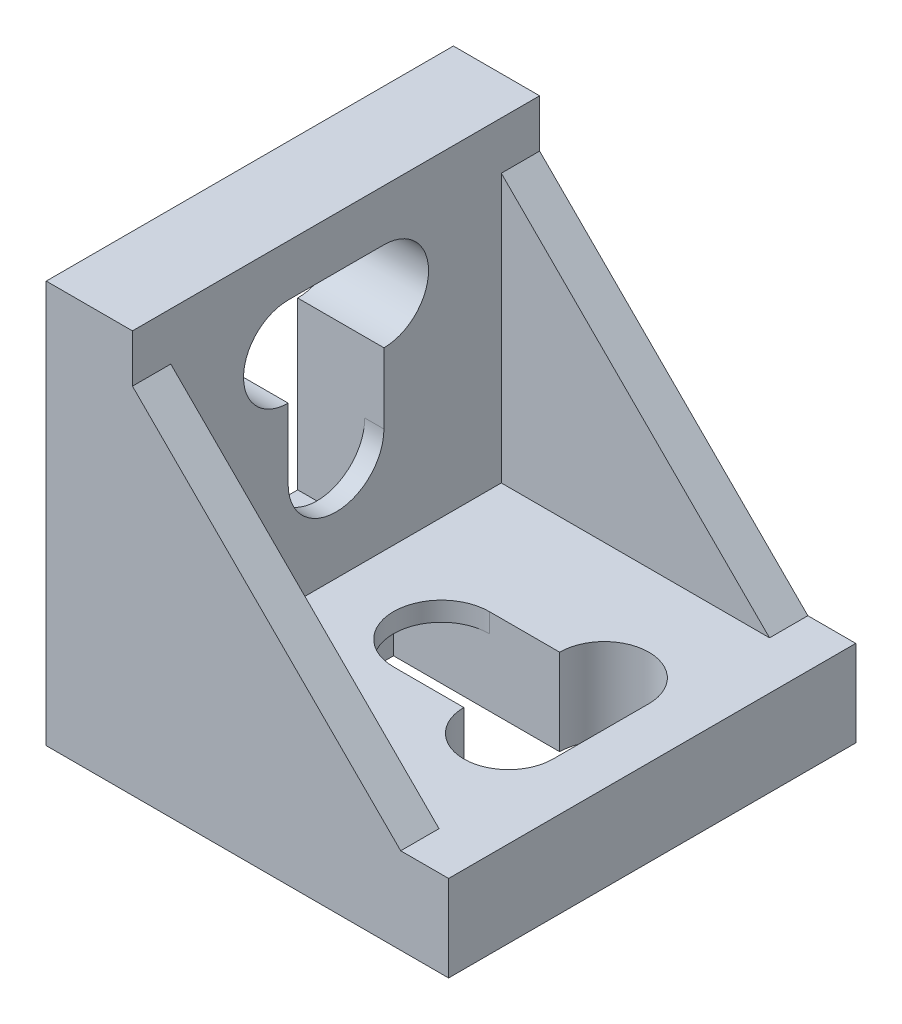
ISO-10303-21;
HEADER;
FILE_DESCRIPTION(('STEP AP214'),'2;1');
FILE_NAME('part.step','',(''),(''),'','','');
FILE_SCHEMA(('AUTOMOTIVE_DESIGN { 1 0 10303 214 1 1 1 1 }'));
ENDSEC;
DATA;
#1=APPLICATION_CONTEXT('core data for automotive mechanical design processes');
#2=APPLICATION_PROTOCOL_DEFINITION('international standard','automotive_design',2000,#1);
#3=PRODUCT_CONTEXT('',#1,'mechanical');
#4=PRODUCT('Part','Part','',(#3));
#5=PRODUCT_RELATED_PRODUCT_CATEGORY('part','',(#4));
#6=PRODUCT_DEFINITION_FORMATION('','',#4);
#7=PRODUCT_DEFINITION_CONTEXT('part definition',#1,'design');
#8=PRODUCT_DEFINITION('design','',#6,#7);
#9=PRODUCT_DEFINITION_SHAPE('','',#8);
#10=(LENGTH_UNIT() NAMED_UNIT(*) SI_UNIT(.MILLI.,.METRE.));
#11=(NAMED_UNIT(*) PLANE_ANGLE_UNIT() SI_UNIT($,.RADIAN.));
#12=(NAMED_UNIT(*) SI_UNIT($,.STERADIAN.) SOLID_ANGLE_UNIT());
#13=UNCERTAINTY_MEASURE_WITH_UNIT(LENGTH_MEASURE(1.E-05),#10,'distance_accuracy_value','');
#14=(GEOMETRIC_REPRESENTATION_CONTEXT(3) GLOBAL_UNCERTAINTY_ASSIGNED_CONTEXT((#13)) GLOBAL_UNIT_ASSIGNED_CONTEXT((#10,
#11,#12)) REPRESENTATION_CONTEXT('',''));
#15=CARTESIAN_POINT('',(0.,0.,0.));
#16=DIRECTION('',(0.,0.,1.));
#17=DIRECTION('',(1.,0.,0.));
#18=AXIS2_PLACEMENT_3D('',#15,#16,#17);
#19=CARTESIAN_POINT('',(7.,-25.6172349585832,0.));
#20=DIRECTION('',(-1.,0.,0.));
#21=DIRECTION('',(0.,0.,1.));
#22=AXIS2_PLACEMENT_3D('',#19,#20,#21);
#23=PLANE('',#22);
#24=DIRECTION('',(0.,-1.,0.));
#25=VECTOR('',#24,1.);
#26=CARTESIAN_POINT('',(7.,-25.6172349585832,-18.25));
#27=LINE('',#26,#25);
#28=CARTESIAN_POINT('',(7.,40.,-18.25));
#29=VERTEX_POINT('',#28);
#30=CARTESIAN_POINT('',(7.,8.33885131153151,-18.25));
#31=VERTEX_POINT('',#30);
#32=EDGE_CURVE('E581',#29,#31,#27,.T.);
#33=ORIENTED_EDGE('',*,*,#32,.T.);
#34=DIRECTION('',(0.,0.,1.));
#35=VECTOR('',#34,1.);
#36=CARTESIAN_POINT('',(7.,8.33885131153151,-24.3860623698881));
#37=LINE('',#36,#35);
#38=CARTESIAN_POINT('',(7.,8.33885131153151,-8.75));
#39=VERTEX_POINT('',#38);
#40=EDGE_CURVE('E574',#31,#39,#37,.T.);
#41=ORIENTED_EDGE('',*,*,#40,.T.);
#42=DIRECTION('',(0.,1.,0.));
#43=VECTOR('',#42,1.);
#44=CARTESIAN_POINT('',(7.,-25.6172349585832,-8.75));
#45=LINE('',#44,#43);
#46=CARTESIAN_POINT('',(7.,25.5048094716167,-8.75));
#47=VERTEX_POINT('',#46);
#48=EDGE_CURVE('E578',#39,#47,#45,.T.);
#49=ORIENTED_EDGE('',*,*,#48,.T.);
#50=CARTESIAN_POINT('',(7.,32.,-5.));
#51=DIRECTION('',(-1.,0.,0.));
#52=DIRECTION('',(0.,0.,1.));
#53=AXIS2_PLACEMENT_3D('',#50,#51,#52);
#54=CIRCLE('',#53,7.5);
#55=CARTESIAN_POINT('',(7.,38.4951905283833,-8.75));
#56=VERTEX_POINT('',#55);
#57=EDGE_CURVE('E610',#56,#47,#54,.T.);
#58=ORIENTED_EDGE('',*,*,#57,.F.);
#59=DIRECTION('',(0.,-1.,0.));
#60=VECTOR('',#59,1.);
#61=CARTESIAN_POINT('',(7.,-25.6172349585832,-8.74999999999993));
#62=LINE('',#61,#60);
#63=CARTESIAN_POINT('',(7.,40.,-8.75));
#64=VERTEX_POINT('',#63);
#65=EDGE_CURVE('E809',#64,#56,#62,.T.);
#66=ORIENTED_EDGE('',*,*,#65,.F.);
#67=DIRECTION('',(0.,0.,1.));
#68=VECTOR('',#67,1.);
#69=CARTESIAN_POINT('',(7.,40.,0.));
#70=LINE('',#69,#68);
#71=EDGE_CURVE('E592',#29,#64,#70,.T.);
#72=ORIENTED_EDGE('',*,*,#71,.F.);
#73=EDGE_LOOP('',(#33,#41,#49,#58,#66,#72));
#74=FACE_BOUND('',#73,.T.);
#75=ADVANCED_FACE('F35',(#74),#23,.T.);
#76=CARTESIAN_POINT('',(7.,-25.6172349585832,-8.75));
#77=DIRECTION('',(0.,0.,1.));
#78=DIRECTION('',(1.,0.,0.));
#79=AXIS2_PLACEMENT_3D('',#76,#77,#78);
#80=PLANE('',#79);
#81=ORIENTED_EDGE('',*,*,#48,.F.);
#82=DIRECTION('',(0.707106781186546,0.707106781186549,0.));
#83=VECTOR('',#82,1.);
#84=CARTESIAN_POINT('',(-9.97804313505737,-8.63919182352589,-8.75));
#85=LINE('',#84,#83);
#86=CARTESIAN_POINT('',(0.,1.3388513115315,-8.75));
#87=VERTEX_POINT('',#86);
#88=EDGE_CURVE('E50',#39,#87,#85,.F.);
#89=ORIENTED_EDGE('',*,*,#88,.T.);
#90=DIRECTION('',(0.,1.,0.));
#91=VECTOR('',#90,1.);
#92=CARTESIAN_POINT('',(0.,-25.6172349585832,-8.75));
#93=LINE('',#92,#91);
#94=CARTESIAN_POINT('',(0.,25.5048094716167,-8.75));
#95=VERTEX_POINT('',#94);
#96=EDGE_CURVE('E608',#87,#95,#93,.T.);
#97=ORIENTED_EDGE('',*,*,#96,.T.);
#98=DIRECTION('',(-1.,0.,0.));
#99=VECTOR('',#98,1.);
#100=CARTESIAN_POINT('',(7.,25.5048094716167,-8.75));
#101=LINE('',#100,#99);
#102=EDGE_CURVE('E586',#47,#95,#101,.T.);
#103=ORIENTED_EDGE('',*,*,#102,.F.);
#104=EDGE_LOOP('',(#81,#89,#97,#103));
#105=FACE_BOUND('',#104,.T.);
#106=ADVANCED_FACE('F584',(#105),#80,.F.);
#107=CARTESIAN_POINT('',(7.,-25.6172349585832,-18.25));
#108=DIRECTION('',(0.,0.,-1.));
#109=DIRECTION('',(0.,1.,0.));
#110=AXIS2_PLACEMENT_3D('',#107,#108,#109);
#111=PLANE('',#110);
#112=DIRECTION('',(-0.707106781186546,-0.707106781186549,0.));
#113=VECTOR('',#112,1.);
#114=CARTESIAN_POINT('',(-9.97804313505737,-8.63919182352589,-18.25));
#115=LINE('',#114,#113);
#116=CARTESIAN_POINT('',(0.,1.3388513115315,-18.25));
#117=VERTEX_POINT('',#116);
#118=EDGE_CURVE('E58',#117,#31,#115,.F.);
#119=ORIENTED_EDGE('',*,*,#118,.T.);
#120=ORIENTED_EDGE('',*,*,#32,.F.);
#121=DIRECTION('',(-1.,0.,0.));
#122=VECTOR('',#121,1.);
#123=CARTESIAN_POINT('',(7.,40.,-18.25));
#124=LINE('',#123,#122);
#125=CARTESIAN_POINT('',(0.,40.,-18.25));
#126=VERTEX_POINT('',#125);
#127=EDGE_CURVE('E613',#29,#126,#124,.T.);
#128=ORIENTED_EDGE('',*,*,#127,.T.);
#129=DIRECTION('',(0.,-1.,0.));
#130=VECTOR('',#129,1.);
#131=CARTESIAN_POINT('',(0.,-25.6172349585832,-18.25));
#132=LINE('',#131,#130);
#133=EDGE_CURVE('E606',#126,#117,#132,.T.);
#134=ORIENTED_EDGE('',*,*,#133,.T.);
#135=EDGE_LOOP('',(#119,#120,#128,#134));
#136=FACE_BOUND('',#135,.T.);
#137=ADVANCED_FACE('F824',(#136),#111,.F.);
#138=CARTESIAN_POINT('',(7.,-25.6172349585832,0.));
#139=DIRECTION('',(-1.,0.,0.));
#140=DIRECTION('',(0.,0.,-1.));
#141=AXIS2_PLACEMENT_3D('',#138,#139,#140);
#142=PLANE('',#141);
#143=DIRECTION('',(0.,1.,0.));
#144=VECTOR('',#143,1.);
#145=CARTESIAN_POINT('',(7.,-25.6172349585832,8.75));
#146=LINE('',#145,#144);
#147=CARTESIAN_POINT('',(7.,8.33885131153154,8.75));
#148=VERTEX_POINT('',#147);
#149=CARTESIAN_POINT('',(7.,25.5048094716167,8.75));
#150=VERTEX_POINT('',#149);
#151=EDGE_CURVE('E549',#148,#150,#146,.T.);
#152=ORIENTED_EDGE('',*,*,#151,.F.);
#153=DIRECTION('',(0.,0.,1.));
#154=VECTOR('',#153,1.);
#155=CARTESIAN_POINT('',(7.,8.33885131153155,2.61393763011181));
#156=LINE('',#155,#154);
#157=CARTESIAN_POINT('',(7.,8.33885131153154,18.25));
#158=VERTEX_POINT('',#157);
#159=EDGE_CURVE('E485',#148,#158,#156,.T.);
#160=ORIENTED_EDGE('',*,*,#159,.T.);
#161=DIRECTION('',(0.,-1.,0.));
#162=VECTOR('',#161,1.);
#163=CARTESIAN_POINT('',(7.,-25.6172349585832,18.25));
#164=LINE('',#163,#162);
#165=CARTESIAN_POINT('',(7.,40.,18.25));
#166=VERTEX_POINT('',#165);
#167=EDGE_CURVE('E565',#166,#158,#164,.T.);
#168=ORIENTED_EDGE('',*,*,#167,.F.);
#169=DIRECTION('',(0.,0.,-1.));
#170=VECTOR('',#169,1.);
#171=CARTESIAN_POINT('',(7.,40.,0.));
#172=LINE('',#171,#170);
#173=CARTESIAN_POINT('',(7.,40.,8.75));
#174=VERTEX_POINT('',#173);
#175=EDGE_CURVE('E787',#166,#174,#172,.T.);
#176=ORIENTED_EDGE('',*,*,#175,.T.);
#177=DIRECTION('',(0.,-1.,0.));
#178=VECTOR('',#177,1.);
#179=CARTESIAN_POINT('',(7.,-25.6172349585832,8.74999999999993));
#180=LINE('',#179,#178);
#181=CARTESIAN_POINT('',(7.,38.4951905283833,8.75));
#182=VERTEX_POINT('',#181);
#183=EDGE_CURVE('E790',#174,#182,#180,.T.);
#184=ORIENTED_EDGE('',*,*,#183,.T.);
#185=CARTESIAN_POINT('',(7.,32.,5.));
#186=DIRECTION('',(1.,0.,0.));
#187=DIRECTION('',(0.,0.,-1.));
#188=AXIS2_PLACEMENT_3D('',#185,#186,#187);
#189=CIRCLE('',#188,7.5);
#190=EDGE_CURVE('E564',#182,#150,#189,.T.);
#191=ORIENTED_EDGE('',*,*,#190,.T.);
#192=EDGE_LOOP('',(#152,#160,#168,#176,#184,#191));
#193=FACE_BOUND('',#192,.T.);
#194=ADVANCED_FACE('F559',(#193),#142,.T.);
#195=CARTESIAN_POINT('',(7.,-25.6172349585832,18.25));
#196=DIRECTION('',(0.,0.,-1.));
#197=DIRECTION('',(0.,1.,0.));
#198=AXIS2_PLACEMENT_3D('',#195,#196,#197);
#199=PLANE('',#198);
#200=ORIENTED_EDGE('',*,*,#167,.T.);
#201=DIRECTION('',(-0.707106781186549,-0.707106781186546,0.));
#202=VECTOR('',#201,1.);
#203=CARTESIAN_POINT('',(0.,1.33885131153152,18.25));
#204=LINE('',#203,#202);
#205=CARTESIAN_POINT('',(0.,1.33885131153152,18.25));
#206=VERTEX_POINT('',#205);
#207=EDGE_CURVE('E11',#158,#206,#204,.T.);
#208=ORIENTED_EDGE('',*,*,#207,.T.);
#209=DIRECTION('',(0.,-1.,0.));
#210=VECTOR('',#209,1.);
#211=CARTESIAN_POINT('',(0.,-25.6172349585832,18.25));
#212=LINE('',#211,#210);
#213=CARTESIAN_POINT('',(0.,40.,18.25));
#214=VERTEX_POINT('',#213);
#215=EDGE_CURVE('E795',#214,#206,#212,.T.);
#216=ORIENTED_EDGE('',*,*,#215,.F.);
#217=DIRECTION('',(-1.,0.,0.));
#218=VECTOR('',#217,1.);
#219=CARTESIAN_POINT('',(7.,40.,18.25));
#220=LINE('',#219,#218);
#221=EDGE_CURVE('E805',#166,#214,#220,.T.);
#222=ORIENTED_EDGE('',*,*,#221,.F.);
#223=EDGE_LOOP('',(#200,#208,#216,#222));
#224=FACE_BOUND('',#223,.T.);
#225=ADVANCED_FACE('F832',(#224),#199,.T.);
#226=CARTESIAN_POINT('',(7.,-25.6172349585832,8.75));
#227=DIRECTION('',(0.,0.,1.));
#228=DIRECTION('',(1.,0.,0.));
#229=AXIS2_PLACEMENT_3D('',#226,#227,#228);
#230=PLANE('',#229);
#231=DIRECTION('',(0.707106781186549,0.707106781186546,0.));
#232=VECTOR('',#231,1.);
#233=CARTESIAN_POINT('',(0.,1.33885131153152,8.75));
#234=LINE('',#233,#232);
#235=CARTESIAN_POINT('',(0.,1.33885131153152,8.75));
#236=VERTEX_POINT('',#235);
#237=EDGE_CURVE('E43',#236,#148,#234,.T.);
#238=ORIENTED_EDGE('',*,*,#237,.T.);
#239=ORIENTED_EDGE('',*,*,#151,.T.);
#240=DIRECTION('',(-1.,0.,0.));
#241=VECTOR('',#240,1.);
#242=CARTESIAN_POINT('',(7.,25.5048094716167,8.75));
#243=LINE('',#242,#241);
#244=CARTESIAN_POINT('',(0.,25.5048094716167,8.75));
#245=VERTEX_POINT('',#244);
#246=EDGE_CURVE('E792',#150,#245,#243,.T.);
#247=ORIENTED_EDGE('',*,*,#246,.T.);
#248=DIRECTION('',(0.,1.,0.));
#249=VECTOR('',#248,1.);
#250=CARTESIAN_POINT('',(0.,-25.6172349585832,8.75));
#251=LINE('',#250,#249);
#252=EDGE_CURVE('E552',#236,#245,#251,.T.);
#253=ORIENTED_EDGE('',*,*,#252,.F.);
#254=EDGE_LOOP('',(#238,#239,#247,#253));
#255=FACE_BOUND('',#254,.T.);
#256=ADVANCED_FACE('F547',(#255),#230,.T.);
#257=CARTESIAN_POINT('',(42.,0.,21.25));
#258=DIRECTION('',(0.,1.,0.));
#259=DIRECTION('',(-1.,0.,0.));
#260=AXIS2_PLACEMENT_3D('',#257,#258,#259);
#261=PLANE('',#260);
#262=DIRECTION('',(0.,0.,-1.));
#263=VECTOR('',#262,1.);
#264=CARTESIAN_POINT('',(8.11245787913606,0.,-3.58181491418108));
#265=LINE('',#264,#263);
#266=CARTESIAN_POINT('',(8.11245787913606,0.,4.21818508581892));
#267=VERTEX_POINT('',#266);
#268=CARTESIAN_POINT('',(8.11245787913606,0.,-3.58181491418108));
#269=VERTEX_POINT('',#268);
#270=EDGE_CURVE('E484',#267,#269,#265,.T.);
#271=ORIENTED_EDGE('',*,*,#270,.T.);
#272=DIRECTION('',(-1.,0.,0.));
#273=VECTOR('',#272,1.);
#274=CARTESIAN_POINT('',(6.11245787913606,0.,-3.58181491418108));
#275=LINE('',#274,#273);
#276=CARTESIAN_POINT('',(6.11245787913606,0.,-3.58181491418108));
#277=VERTEX_POINT('',#276);
#278=EDGE_CURVE('E457',#269,#277,#275,.T.);
#279=ORIENTED_EDGE('',*,*,#278,.T.);
#280=DIRECTION('',(0.,0.,1.));
#281=VECTOR('',#280,1.);
#282=CARTESIAN_POINT('',(6.11245787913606,0.,4.21818508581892));
#283=LINE('',#282,#281);
#284=CARTESIAN_POINT('',(6.11245787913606,0.,4.21818508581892));
#285=VERTEX_POINT('',#284);
#286=EDGE_CURVE('E473',#277,#285,#283,.T.);
#287=ORIENTED_EDGE('',*,*,#286,.T.);
#288=DIRECTION('',(1.,0.,0.));
#289=VECTOR('',#288,1.);
#290=CARTESIAN_POINT('',(8.11245787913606,0.,4.21818508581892));
#291=LINE('',#290,#289);
#292=EDGE_CURVE('E487',#285,#267,#291,.T.);
#293=ORIENTED_EDGE('',*,*,#292,.T.);
#294=EDGE_LOOP('',(#271,#279,#287,#293));
#295=FACE_BOUND('',#294,.T.);
#296=DIRECTION('',(0.,0.,-1.));
#297=VECTOR('',#296,1.);
#298=CARTESIAN_POINT('',(38.6562082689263,0.,4.21818508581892));
#299=LINE('',#298,#297);
#300=CARTESIAN_POINT('',(38.6562082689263,0.,4.21818508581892));
#301=VERTEX_POINT('',#300);
#302=CARTESIAN_POINT('',(38.6562082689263,0.,-3.58181491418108));
#303=VERTEX_POINT('',#302);
#304=EDGE_CURVE('E512',#301,#303,#299,.T.);
#305=ORIENTED_EDGE('',*,*,#304,.T.);
#306=DIRECTION('',(-1.,0.,0.));
#307=VECTOR('',#306,1.);
#308=CARTESIAN_POINT('',(38.6562082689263,0.,-3.58181491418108));
#309=LINE('',#308,#307);
#310=CARTESIAN_POINT('',(36.6562082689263,0.,-3.58181491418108));
#311=VERTEX_POINT('',#310);
#312=EDGE_CURVE('E462',#303,#311,#309,.T.);
#313=ORIENTED_EDGE('',*,*,#312,.T.);
#314=DIRECTION('',(0.,0.,-1.));
#315=VECTOR('',#314,1.);
#316=CARTESIAN_POINT('',(36.6562082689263,0.,-5.));
#317=LINE('',#316,#315);
#318=CARTESIAN_POINT('',(36.6562082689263,0.,-5.));
#319=VERTEX_POINT('',#318);
#320=EDGE_CURVE('E923',#311,#319,#317,.T.);
#321=ORIENTED_EDGE('',*,*,#320,.T.);
#322=CARTESIAN_POINT('',(32.,0.,-5.));
#323=DIRECTION('',(0.,1.,0.));
#324=DIRECTION('',(0.,0.,1.));
#325=AXIS2_PLACEMENT_3D('',#322,#323,#324);
#326=CIRCLE('',#325,4.65620826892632);
#327=CARTESIAN_POINT('',(27.3437917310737,0.,-5.));
#328=VERTEX_POINT('',#327);
#329=EDGE_CURVE('E918',#319,#328,#326,.T.);
#330=ORIENTED_EDGE('',*,*,#329,.T.);
#331=DIRECTION('',(-1.,0.,0.));
#332=VECTOR('',#331,1.);
#333=CARTESIAN_POINT('',(30.,0.,-5.));
#334=LINE('',#333,#332);
#335=CARTESIAN_POINT('',(10.,0.,-5.));
#336=VERTEX_POINT('',#335);
#337=EDGE_CURVE('E1839',#328,#336,#334,.T.);
#338=ORIENTED_EDGE('',*,*,#337,.T.);
#339=DIRECTION('',(0.,0.,1.));
#340=VECTOR('',#339,1.);
#341=CARTESIAN_POINT('',(10.,0.,-5.));
#342=LINE('',#341,#340);
#343=CARTESIAN_POINT('',(10.,0.,5.));
#344=VERTEX_POINT('',#343);
#345=EDGE_CURVE('E900',#336,#344,#342,.T.);
#346=ORIENTED_EDGE('',*,*,#345,.T.);
#347=DIRECTION('',(1.,0.,0.));
#348=VECTOR('',#347,1.);
#349=CARTESIAN_POINT('',(30.,0.,5.));
#350=LINE('',#349,#348);
#351=CARTESIAN_POINT('',(27.3437917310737,0.,5.));
#352=VERTEX_POINT('',#351);
#353=EDGE_CURVE('E1844',#344,#352,#350,.T.);
#354=ORIENTED_EDGE('',*,*,#353,.T.);
#355=CARTESIAN_POINT('',(32.,0.,5.));
#356=DIRECTION('',(0.,1.,0.));
#357=DIRECTION('',(0.,0.,1.));
#358=AXIS2_PLACEMENT_3D('',#355,#356,#357);
#359=CIRCLE('',#358,4.65620826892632);
#360=CARTESIAN_POINT('',(36.6562082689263,0.,5.));
#361=VERTEX_POINT('',#360);
#362=EDGE_CURVE('E926',#352,#361,#359,.T.);
#363=ORIENTED_EDGE('',*,*,#362,.T.);
#364=CARTESIAN_POINT('',(36.6562082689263,0.,4.21818508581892));
#365=VERTEX_POINT('',#364);
#366=EDGE_CURVE('E932',#361,#365,#317,.T.);
#367=ORIENTED_EDGE('',*,*,#366,.T.);
#368=DIRECTION('',(1.,0.,0.));
#369=VECTOR('',#368,1.);
#370=CARTESIAN_POINT('',(36.6562082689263,0.,4.21818508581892));
#371=LINE('',#370,#369);
#372=EDGE_CURVE('E500',#365,#301,#371,.T.);
#373=ORIENTED_EDGE('',*,*,#372,.T.);
#374=EDGE_LOOP('',(#305,#313,#321,#330,#338,#346,#354,#363,#367,#373));
#375=FACE_BOUND('',#374,.T.);
#376=DIRECTION('',(1.,0.,0.));
#377=VECTOR('',#376,1.);
#378=CARTESIAN_POINT('',(42.,0.,-21.25));
#379=LINE('',#378,#377);
#380=CARTESIAN_POINT('',(0.,0.,-21.25));
#381=VERTEX_POINT('',#380);
#382=CARTESIAN_POINT('',(42.,0.,-21.25));
#383=VERTEX_POINT('',#382);
#384=EDGE_CURVE('E682',#381,#383,#379,.T.);
#385=ORIENTED_EDGE('',*,*,#384,.T.);
#386=DIRECTION('',(0.,0.,-1.));
#387=VECTOR('',#386,1.);
#388=CARTESIAN_POINT('',(42.,0.,21.25));
#389=LINE('',#388,#387);
#390=CARTESIAN_POINT('',(42.,0.,21.25));
#391=VERTEX_POINT('',#390);
#392=EDGE_CURVE('E657',#391,#383,#389,.T.);
#393=ORIENTED_EDGE('',*,*,#392,.F.);
#394=DIRECTION('',(1.,0.,0.));
#395=VECTOR('',#394,1.);
#396=CARTESIAN_POINT('',(42.,0.,21.25));
#397=LINE('',#396,#395);
#398=CARTESIAN_POINT('',(0.,0.,21.25));
#399=VERTEX_POINT('',#398);
#400=EDGE_CURVE('E696',#399,#391,#397,.T.);
#401=ORIENTED_EDGE('',*,*,#400,.F.);
#402=DIRECTION('',(0.,0.,-1.));
#403=VECTOR('',#402,1.);
#404=CARTESIAN_POINT('',(0.,0.,21.25));
#405=LINE('',#404,#403);
#406=EDGE_CURVE('E653',#399,#381,#405,.T.);
#407=ORIENTED_EDGE('',*,*,#406,.T.);
#408=EDGE_LOOP('',(#385,#393,#401,#407));
#409=FACE_BOUND('',#408,.T.);
#410=DIRECTION('',(0.,0.,1.));
#411=VECTOR('',#410,1.);
#412=CARTESIAN_POINT('',(1.33885131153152,0.,-8.75));
#413=LINE('',#412,#411);
#414=CARTESIAN_POINT('',(1.33885131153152,0.,-18.25));
#415=VERTEX_POINT('',#414);
#416=CARTESIAN_POINT('',(1.33885131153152,0.,-8.75));
#417=VERTEX_POINT('',#416);
#418=EDGE_CURVE('E520',#415,#417,#413,.T.);
#419=ORIENTED_EDGE('',*,*,#418,.T.);
#420=DIRECTION('',(1.,0.,0.));
#421=VECTOR('',#420,1.);
#422=CARTESIAN_POINT('',(0.,0.,-8.75));
#423=LINE('',#422,#421);
#424=CARTESIAN_POINT('',(25.5048094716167,0.,-8.75));
#425=VERTEX_POINT('',#424);
#426=EDGE_CURVE('E858',#417,#425,#423,.T.);
#427=ORIENTED_EDGE('',*,*,#426,.T.);
#428=CARTESIAN_POINT('',(32.,0.,-5.));
#429=DIRECTION('',(0.,1.,0.));
#430=DIRECTION('',(0.,0.,1.));
#431=AXIS2_PLACEMENT_3D('',#428,#429,#430);
#432=CIRCLE('',#431,7.5);
#433=CARTESIAN_POINT('',(38.4951905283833,0.,-8.75));
#434=VERTEX_POINT('',#433);
#435=EDGE_CURVE('E887',#434,#425,#432,.T.);
#436=ORIENTED_EDGE('',*,*,#435,.F.);
#437=DIRECTION('',(-1.,0.,0.));
#438=VECTOR('',#437,1.);
#439=CARTESIAN_POINT('',(0.,0.,-8.74999999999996));
#440=LINE('',#439,#438);
#441=CARTESIAN_POINT('',(40.,0.,-8.75));
#442=VERTEX_POINT('',#441);
#443=EDGE_CURVE('E895',#442,#434,#440,.T.);
#444=ORIENTED_EDGE('',*,*,#443,.F.);
#445=DIRECTION('',(0.,0.,1.));
#446=VECTOR('',#445,1.);
#447=CARTESIAN_POINT('',(40.,0.,0.));
#448=LINE('',#447,#446);
#449=CARTESIAN_POINT('',(40.,0.,-18.25));
#450=VERTEX_POINT('',#449);
#451=EDGE_CURVE('E892',#450,#442,#448,.T.);
#452=ORIENTED_EDGE('',*,*,#451,.F.);
#453=DIRECTION('',(-1.,0.,0.));
#454=VECTOR('',#453,1.);
#455=CARTESIAN_POINT('',(0.,0.,-18.25));
#456=LINE('',#455,#454);
#457=EDGE_CURVE('E874',#450,#415,#456,.T.);
#458=ORIENTED_EDGE('',*,*,#457,.T.);
#459=EDGE_LOOP('',(#419,#427,#436,#444,#452,#458));
#460=FACE_BOUND('',#459,.T.);
#461=DIRECTION('',(1.,0.,0.));
#462=VECTOR('',#461,1.);
#463=CARTESIAN_POINT('',(0.,0.,8.75));
#464=LINE('',#463,#462);
#465=CARTESIAN_POINT('',(1.3388513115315,0.,8.75));
#466=VERTEX_POINT('',#465);
#467=CARTESIAN_POINT('',(25.5048094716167,0.,8.75));
#468=VERTEX_POINT('',#467);
#469=EDGE_CURVE('E1791',#466,#468,#464,.T.);
#470=ORIENTED_EDGE('',*,*,#469,.F.);
#471=DIRECTION('',(0.,0.,1.));
#472=VECTOR('',#471,1.);
#473=CARTESIAN_POINT('',(1.3388513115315,0.,21.25));
#474=LINE('',#473,#472);
#475=CARTESIAN_POINT('',(1.3388513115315,0.,18.25));
#476=VERTEX_POINT('',#475);
#477=EDGE_CURVE('E529',#466,#476,#474,.T.);
#478=ORIENTED_EDGE('',*,*,#477,.T.);
#479=DIRECTION('',(-1.,0.,0.));
#480=VECTOR('',#479,1.);
#481=CARTESIAN_POINT('',(0.,0.,18.25));
#482=LINE('',#481,#480);
#483=CARTESIAN_POINT('',(40.,0.,18.25));
#484=VERTEX_POINT('',#483);
#485=EDGE_CURVE('E1789',#484,#476,#482,.T.);
#486=ORIENTED_EDGE('',*,*,#485,.F.);
#487=DIRECTION('',(0.,0.,-1.));
#488=VECTOR('',#487,1.);
#489=CARTESIAN_POINT('',(40.,0.,0.));
#490=LINE('',#489,#488);
#491=CARTESIAN_POINT('',(40.,0.,8.75));
#492=VERTEX_POINT('',#491);
#493=EDGE_CURVE('E1786',#484,#492,#490,.T.);
#494=ORIENTED_EDGE('',*,*,#493,.T.);
#495=DIRECTION('',(-1.,0.,0.));
#496=VECTOR('',#495,1.);
#497=CARTESIAN_POINT('',(0.,0.,8.74999999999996));
#498=LINE('',#497,#496);
#499=CARTESIAN_POINT('',(38.4951905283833,0.,8.75));
#500=VERTEX_POINT('',#499);
#501=EDGE_CURVE('E1782',#492,#500,#498,.T.);
#502=ORIENTED_EDGE('',*,*,#501,.T.);
#503=CARTESIAN_POINT('',(32.,0.,5.));
#504=DIRECTION('',(0.,-1.,0.));
#505=DIRECTION('',(0.,0.,-1.));
#506=AXIS2_PLACEMENT_3D('',#503,#504,#505);
#507=CIRCLE('',#506,7.5);
#508=EDGE_CURVE('E1779',#500,#468,#507,.T.);
#509=ORIENTED_EDGE('',*,*,#508,.T.);
#510=EDGE_LOOP('',(#470,#478,#486,#494,#502,#509));
#511=FACE_BOUND('',#510,.T.);
#512=ADVANCED_FACE('F1053',(#295,#375,#409,#460,#511),#261,.F.);
#513=CARTESIAN_POINT('',(20.,42.,0.));
#514=DIRECTION('',(0.,-1.,0.));
#515=DIRECTION('',(1.,0.,0.));
#516=AXIS2_PLACEMENT_3D('',#513,#514,#515);
#517=CYLINDRICAL_SURFACE('',#516,5.);
#518=DIRECTION('',(0.,-1.,0.));
#519=VECTOR('',#518,1.);
#520=CARTESIAN_POINT('',(20.,42.,5.));
#521=LINE('',#520,#519);
#522=CARTESIAN_POINT('',(20.,9.,5.));
#523=VERTEX_POINT('',#522);
#524=CARTESIAN_POINT('',(20.,7.00000000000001,5.));
#525=VERTEX_POINT('',#524);
#526=EDGE_CURVE('E1843',#523,#525,#521,.T.);
#527=ORIENTED_EDGE('',*,*,#526,.T.);
#528=CARTESIAN_POINT('',(20.,7.00000000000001,0.));
#529=DIRECTION('',(0.,-1.,0.));
#530=DIRECTION('',(1.,0.,0.));
#531=AXIS2_PLACEMENT_3D('',#528,#529,#530);
#532=CIRCLE('',#531,5.);
#533=CARTESIAN_POINT('',(20.,7.00000000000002,-5.));
#534=VERTEX_POINT('',#533);
#535=EDGE_CURVE('E524',#525,#534,#532,.T.);
#536=ORIENTED_EDGE('',*,*,#535,.T.);
#537=DIRECTION('',(0.,-1.,0.));
#538=VECTOR('',#537,1.);
#539=CARTESIAN_POINT('',(20.,42.,-5.));
#540=LINE('',#539,#538);
#541=CARTESIAN_POINT('',(20.,9.00000000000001,-5.));
#542=VERTEX_POINT('',#541);
#543=EDGE_CURVE('E1847',#542,#534,#540,.T.);
#544=ORIENTED_EDGE('',*,*,#543,.F.);
#545=CARTESIAN_POINT('',(20.,9.,0.));
#546=DIRECTION('',(0.,-1.,0.));
#547=DIRECTION('',(0.,0.,-1.));
#548=AXIS2_PLACEMENT_3D('',#545,#546,#547);
#549=CIRCLE('',#548,5.);
#550=EDGE_CURVE('E1857',#542,#523,#549,.F.);
#551=ORIENTED_EDGE('',*,*,#550,.T.);
#552=EDGE_LOOP('',(#527,#536,#544,#551));
#553=FACE_BOUND('',#552,.T.);
#554=ADVANCED_FACE('F1118',(#553),#517,.F.);
#555=CARTESIAN_POINT('',(9.,9.,21.25));
#556=DIRECTION('',(0.,-1.,0.));
#557=DIRECTION('',(0.,0.,-1.));
#558=AXIS2_PLACEMENT_3D('',#555,#556,#557);
#559=PLANE('',#558);
#560=DIRECTION('',(0.,0.,-1.));
#561=VECTOR('',#560,1.);
#562=CARTESIAN_POINT('',(37.,9.,-17.25));
#563=LINE('',#562,#561);
#564=CARTESIAN_POINT('',(37.,9.,-17.25));
#565=VERTEX_POINT('',#564);
#566=CARTESIAN_POINT('',(37.,9.,-21.25));
#567=VERTEX_POINT('',#566);
#568=EDGE_CURVE('E709',#565,#567,#563,.T.);
#569=ORIENTED_EDGE('',*,*,#568,.F.);
#570=DIRECTION('',(1.,0.,0.));
#571=VECTOR('',#570,1.);
#572=CARTESIAN_POINT('',(37.,9.,-17.25));
#573=LINE('',#572,#571);
#574=CARTESIAN_POINT('',(9.,9.,-17.25));
#575=VERTEX_POINT('',#574);
#576=EDGE_CURVE('E719',#575,#565,#573,.T.);
#577=ORIENTED_EDGE('',*,*,#576,.F.);
#578=DIRECTION('',(0.,0.,-1.));
#579=VECTOR('',#578,1.);
#580=CARTESIAN_POINT('',(9.,9.,21.25));
#581=LINE('',#580,#579);
#582=CARTESIAN_POINT('',(9.,9.,17.25));
#583=VERTEX_POINT('',#582);
#584=EDGE_CURVE('E663',#583,#575,#581,.T.);
#585=ORIENTED_EDGE('',*,*,#584,.F.);
#586=DIRECTION('',(1.,0.,0.));
#587=VECTOR('',#586,1.);
#588=CARTESIAN_POINT('',(37.,9.,17.25));
#589=LINE('',#588,#587);
#590=CARTESIAN_POINT('',(37.,9.,17.25));
#591=VERTEX_POINT('',#590);
#592=EDGE_CURVE('E712',#583,#591,#589,.T.);
#593=ORIENTED_EDGE('',*,*,#592,.T.);
#594=DIRECTION('',(0.,0.,1.));
#595=VECTOR('',#594,1.);
#596=CARTESIAN_POINT('',(37.,9.,17.25));
#597=LINE('',#596,#595);
#598=CARTESIAN_POINT('',(37.,9.,21.25));
#599=VERTEX_POINT('',#598);
#600=EDGE_CURVE('E700',#591,#599,#597,.T.);
#601=ORIENTED_EDGE('',*,*,#600,.T.);
#602=DIRECTION('',(-1.,0.,0.));
#603=VECTOR('',#602,1.);
#604=CARTESIAN_POINT('',(9.,9.,21.25));
#605=LINE('',#604,#603);
#606=CARTESIAN_POINT('',(42.,9.,21.25));
#607=VERTEX_POINT('',#606);
#608=EDGE_CURVE('E691',#607,#599,#605,.T.);
#609=ORIENTED_EDGE('',*,*,#608,.F.);
#610=DIRECTION('',(0.,0.,-1.));
#611=VECTOR('',#610,1.);
#612=CARTESIAN_POINT('',(42.,9.,21.25));
#613=LINE('',#612,#611);
#614=CARTESIAN_POINT('',(42.,9.,-21.25));
#615=VERTEX_POINT('',#614);
#616=EDGE_CURVE('E660',#607,#615,#613,.T.);
#617=ORIENTED_EDGE('',*,*,#616,.T.);
#618=DIRECTION('',(-1.,0.,0.));
#619=VECTOR('',#618,1.);
#620=CARTESIAN_POINT('',(9.,9.,-21.25));
#621=LINE('',#620,#619);
#622=EDGE_CURVE('E678',#615,#567,#621,.T.);
#623=ORIENTED_EDGE('',*,*,#622,.T.);
#624=EDGE_LOOP('',(#569,#577,#585,#593,#601,#609,#617,#623));
#625=FACE_BOUND('',#624,.T.);
#626=CARTESIAN_POINT('',(32.,9.,-5.));
#627=DIRECTION('',(0.,-1.,0.));
#628=DIRECTION('',(0.,0.,-1.));
#629=AXIS2_PLACEMENT_3D('',#626,#627,#628);
#630=CIRCLE('',#629,4.65620826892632);
#631=CARTESIAN_POINT('',(36.6562082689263,9.,-5.));
#632=VERTEX_POINT('',#631);
#633=CARTESIAN_POINT('',(27.3437917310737,9.00000000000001,-5.));
#634=VERTEX_POINT('',#633);
#635=EDGE_CURVE('E1905',#632,#634,#630,.F.);
#636=ORIENTED_EDGE('',*,*,#635,.F.);
#637=DIRECTION('',(0.,0.,-1.));
#638=VECTOR('',#637,1.);
#639=CARTESIAN_POINT('',(36.6562082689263,9.,21.25));
#640=LINE('',#639,#638);
#641=CARTESIAN_POINT('',(36.6562082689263,9.,5.));
#642=VERTEX_POINT('',#641);
#643=EDGE_CURVE('E1832',#642,#632,#640,.T.);
#644=ORIENTED_EDGE('',*,*,#643,.F.);
#645=CARTESIAN_POINT('',(32.,9.,5.));
#646=DIRECTION('',(0.,-1.,0.));
#647=DIRECTION('',(0.,0.,-1.));
#648=AXIS2_PLACEMENT_3D('',#645,#646,#647);
#649=CIRCLE('',#648,4.65620826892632);
#650=CARTESIAN_POINT('',(27.3437917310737,9.00000000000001,5.));
#651=VERTEX_POINT('',#650);
#652=EDGE_CURVE('E1894',#651,#642,#649,.F.);
#653=ORIENTED_EDGE('',*,*,#652,.F.);
#654=DIRECTION('',(1.,0.,0.));
#655=VECTOR('',#654,1.);
#656=CARTESIAN_POINT('',(9.,9.,5.));
#657=LINE('',#656,#655);
#658=EDGE_CURVE('E1853',#523,#651,#657,.T.);
#659=ORIENTED_EDGE('',*,*,#658,.F.);
#660=ORIENTED_EDGE('',*,*,#550,.F.);
#661=DIRECTION('',(-1.,0.,0.));
#662=VECTOR('',#661,1.);
#663=CARTESIAN_POINT('',(9.,9.,-5.));
#664=LINE('',#663,#662);
#665=EDGE_CURVE('E1860',#634,#542,#664,.T.);
#666=ORIENTED_EDGE('',*,*,#665,.F.);
#667=EDGE_LOOP('',(#636,#644,#653,#659,#660,#666));
#668=FACE_BOUND('',#667,.T.);
#669=ADVANCED_FACE('F1093',(#625,#668),#559,.F.);
#670=CARTESIAN_POINT('',(30.,42.,-5.));
#671=DIRECTION('',(0.,0.,1.));
#672=DIRECTION('',(1.,0.,0.));
#673=AXIS2_PLACEMENT_3D('',#670,#671,#672);
#674=PLANE('',#673);
#675=DIRECTION('',(0.,-1.,0.));
#676=VECTOR('',#675,1.);
#677=CARTESIAN_POINT('',(10.,7.,-5.));
#678=LINE('',#677,#676);
#679=CARTESIAN_POINT('',(10.,7.,-5.));
#680=VERTEX_POINT('',#679);
#681=EDGE_CURVE('E915',#680,#336,#678,.T.);
#682=ORIENTED_EDGE('',*,*,#681,.T.);
#683=ORIENTED_EDGE('',*,*,#337,.F.);
#684=DIRECTION('',(0.,-1.,0.));
#685=VECTOR('',#684,1.);
#686=CARTESIAN_POINT('',(27.3437917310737,42.,-5.));
#687=LINE('',#686,#685);
#688=EDGE_CURVE('E1837',#634,#328,#687,.T.);
#689=ORIENTED_EDGE('',*,*,#688,.F.);
#690=ORIENTED_EDGE('',*,*,#665,.T.);
#691=ORIENTED_EDGE('',*,*,#543,.T.);
#692=DIRECTION('',(-1.,0.,0.));
#693=VECTOR('',#692,1.);
#694=CARTESIAN_POINT('',(23.6718958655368,7.00000000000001,-5.));
#695=LINE('',#694,#693);
#696=EDGE_CURVE('E910',#534,#680,#695,.T.);
#697=ORIENTED_EDGE('',*,*,#696,.T.);
#698=EDGE_LOOP('',(#682,#683,#689,#690,#691,#697));
#699=FACE_BOUND('',#698,.T.);
#700=ADVANCED_FACE('F1428',(#699),#674,.T.);
#701=CARTESIAN_POINT('',(30.,42.,5.));
#702=DIRECTION('',(0.,0.,-1.));
#703=DIRECTION('',(-1.,0.,0.));
#704=AXIS2_PLACEMENT_3D('',#701,#702,#703);
#705=PLANE('',#704);
#706=DIRECTION('',(0.,-1.,0.));
#707=VECTOR('',#706,1.);
#708=CARTESIAN_POINT('',(27.3437917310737,42.,5.));
#709=LINE('',#708,#707);
#710=EDGE_CURVE('E656',#651,#352,#709,.T.);
#711=ORIENTED_EDGE('',*,*,#710,.T.);
#712=ORIENTED_EDGE('',*,*,#353,.F.);
#713=DIRECTION('',(0.,-1.,0.));
#714=VECTOR('',#713,1.);
#715=CARTESIAN_POINT('',(10.,7.,5.));
#716=LINE('',#715,#714);
#717=CARTESIAN_POINT('',(10.,7.,5.));
#718=VERTEX_POINT('',#717);
#719=EDGE_CURVE('E912',#718,#344,#716,.T.);
#720=ORIENTED_EDGE('',*,*,#719,.F.);
#721=DIRECTION('',(1.,0.,0.));
#722=VECTOR('',#721,1.);
#723=CARTESIAN_POINT('',(10.,7.,5.));
#724=LINE('',#723,#722);
#725=EDGE_CURVE('E905',#718,#525,#724,.T.);
#726=ORIENTED_EDGE('',*,*,#725,.T.);
#727=ORIENTED_EDGE('',*,*,#526,.F.);
#728=ORIENTED_EDGE('',*,*,#658,.T.);
#729=EDGE_LOOP('',(#711,#712,#720,#726,#727,#728));
#730=FACE_BOUND('',#729,.T.);
#731=ADVANCED_FACE('F1063',(#730),#705,.T.);
#732=CARTESIAN_POINT('',(0.,0.,21.25));
#733=DIRECTION('',(1.,0.,0.));
#734=DIRECTION('',(0.,0.,-1.));
#735=AXIS2_PLACEMENT_3D('',#732,#733,#734);
#736=PLANE('',#735);
#737=DIRECTION('',(0.,-1.,0.));
#738=VECTOR('',#737,1.);
#739=CARTESIAN_POINT('',(0.,38.6562082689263,-3.58181491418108));
#740=LINE('',#739,#738);
#741=CARTESIAN_POINT('',(0.,38.6562082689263,-3.58181491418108));
#742=VERTEX_POINT('',#741);
#743=CARTESIAN_POINT('',(0.,36.6562082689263,-3.58181491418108));
#744=VERTEX_POINT('',#743);
#745=EDGE_CURVE('E946',#742,#744,#740,.T.);
#746=ORIENTED_EDGE('',*,*,#745,.F.);
#747=DIRECTION('',(0.,0.,-1.));
#748=VECTOR('',#747,1.);
#749=CARTESIAN_POINT('',(0.,38.6562082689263,4.21818508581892));
#750=LINE('',#749,#748);
#751=CARTESIAN_POINT('',(0.,38.6562082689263,4.21818508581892));
#752=VERTEX_POINT('',#751);
#753=EDGE_CURVE('E950',#752,#742,#750,.T.);
#754=ORIENTED_EDGE('',*,*,#753,.F.);
#755=DIRECTION('',(0.,1.,0.));
#756=VECTOR('',#755,1.);
#757=CARTESIAN_POINT('',(0.,36.6562082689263,4.21818508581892));
#758=LINE('',#757,#756);
#759=CARTESIAN_POINT('',(0.,36.6562082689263,4.21818508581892));
#760=VERTEX_POINT('',#759);
#761=EDGE_CURVE('E972',#760,#752,#758,.T.);
#762=ORIENTED_EDGE('',*,*,#761,.F.);
#763=DIRECTION('',(0.,0.,-1.));
#764=VECTOR('',#763,1.);
#765=CARTESIAN_POINT('',(0.,36.6562082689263,-5.));
#766=LINE('',#765,#764);
#767=CARTESIAN_POINT('',(0.,36.6562082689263,5.));
#768=VERTEX_POINT('',#767);
#769=EDGE_CURVE('E649',#768,#760,#766,.T.);
#770=ORIENTED_EDGE('',*,*,#769,.F.);
#771=CARTESIAN_POINT('',(0.,32.,5.));
#772=DIRECTION('',(-1.,0.,0.));
#773=DIRECTION('',(0.,0.,1.));
#774=AXIS2_PLACEMENT_3D('',#771,#772,#773);
#775=CIRCLE('',#774,4.65620826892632);
#776=CARTESIAN_POINT('',(0.,27.3437917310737,5.));
#777=VERTEX_POINT('',#776);
#778=EDGE_CURVE('E637',#777,#768,#775,.T.);
#779=ORIENTED_EDGE('',*,*,#778,.F.);
#780=DIRECTION('',(0.,1.,0.));
#781=VECTOR('',#780,1.);
#782=CARTESIAN_POINT('',(0.,30.,5.));
#783=LINE('',#782,#781);
#784=CARTESIAN_POINT('',(0.,10.,5.));
#785=VERTEX_POINT('',#784);
#786=EDGE_CURVE('E617',#785,#777,#783,.T.);
#787=ORIENTED_EDGE('',*,*,#786,.F.);
#788=DIRECTION('',(0.,0.,1.));
#789=VECTOR('',#788,1.);
#790=CARTESIAN_POINT('',(0.,10.,-5.));
#791=LINE('',#790,#789);
#792=CARTESIAN_POINT('',(0.,10.,-5.));
#793=VERTEX_POINT('',#792);
#794=EDGE_CURVE('E761',#793,#785,#791,.T.);
#795=ORIENTED_EDGE('',*,*,#794,.F.);
#796=DIRECTION('',(0.,-1.,0.));
#797=VECTOR('',#796,1.);
#798=CARTESIAN_POINT('',(0.,30.,-5.));
#799=LINE('',#798,#797);
#800=CARTESIAN_POINT('',(0.,27.3437917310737,-5.));
#801=VERTEX_POINT('',#800);
#802=EDGE_CURVE('E612',#801,#793,#799,.T.);
#803=ORIENTED_EDGE('',*,*,#802,.F.);
#804=CARTESIAN_POINT('',(0.,32.,-5.));
#805=DIRECTION('',(-1.,0.,0.));
#806=DIRECTION('',(0.,0.,1.));
#807=AXIS2_PLACEMENT_3D('',#804,#805,#806);
#808=CIRCLE('',#807,4.65620826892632);
#809=CARTESIAN_POINT('',(0.,36.6562082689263,-5.));
#810=VERTEX_POINT('',#809);
#811=EDGE_CURVE('E634',#810,#801,#808,.T.);
#812=ORIENTED_EDGE('',*,*,#811,.F.);
#813=EDGE_CURVE('E640',#744,#810,#766,.T.);
#814=ORIENTED_EDGE('',*,*,#813,.F.);
#815=EDGE_LOOP('',(#746,#754,#762,#770,#779,#787,#795,#803,#812,#814));
#816=FACE_BOUND('',#815,.T.);
#817=DIRECTION('',(0.,0.,-1.));
#818=VECTOR('',#817,1.);
#819=CARTESIAN_POINT('',(0.,1.33885131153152,8.75));
#820=LINE('',#819,#818);
#821=EDGE_CURVE('E542',#206,#236,#820,.T.);
#822=ORIENTED_EDGE('',*,*,#821,.T.);
#823=ORIENTED_EDGE('',*,*,#252,.T.);
#824=CARTESIAN_POINT('',(0.,32.,5.));
#825=DIRECTION('',(1.,0.,0.));
#826=DIRECTION('',(0.,0.,-1.));
#827=AXIS2_PLACEMENT_3D('',#824,#825,#826);
#828=CIRCLE('',#827,7.5);
#829=CARTESIAN_POINT('',(0.,38.4951905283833,8.75));
#830=VERTEX_POINT('',#829);
#831=EDGE_CURVE('E783',#830,#245,#828,.T.);
#832=ORIENTED_EDGE('',*,*,#831,.F.);
#833=DIRECTION('',(0.,-1.,0.));
#834=VECTOR('',#833,1.);
#835=CARTESIAN_POINT('',(0.,-25.6172349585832,8.74999999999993));
#836=LINE('',#835,#834);
#837=CARTESIAN_POINT('',(0.,40.,8.75));
#838=VERTEX_POINT('',#837);
#839=EDGE_CURVE('E784',#838,#830,#836,.T.);
#840=ORIENTED_EDGE('',*,*,#839,.F.);
#841=DIRECTION('',(0.,0.,-1.));
#842=VECTOR('',#841,1.);
#843=CARTESIAN_POINT('',(0.,40.,0.));
#844=LINE('',#843,#842);
#845=EDGE_CURVE('E797',#214,#838,#844,.T.);
#846=ORIENTED_EDGE('',*,*,#845,.F.);
#847=ORIENTED_EDGE('',*,*,#215,.T.);
#848=EDGE_LOOP('',(#822,#823,#832,#840,#846,#847));
#849=FACE_BOUND('',#848,.T.);
#850=DIRECTION('',(0.,-1.,0.));
#851=VECTOR('',#850,1.);
#852=CARTESIAN_POINT('',(0.,0.,-21.25));
#853=LINE('',#852,#851);
#854=CARTESIAN_POINT('',(0.,42.,-21.25));
#855=VERTEX_POINT('',#854);
#856=EDGE_CURVE('E684',#855,#381,#853,.T.);
#857=ORIENTED_EDGE('',*,*,#856,.T.);
#858=ORIENTED_EDGE('',*,*,#406,.F.);
#859=DIRECTION('',(0.,-1.,0.));
#860=VECTOR('',#859,1.);
#861=CARTESIAN_POINT('',(0.,0.,21.25));
#862=LINE('',#861,#860);
#863=CARTESIAN_POINT('',(0.,42.,21.25));
#864=VERTEX_POINT('',#863);
#865=EDGE_CURVE('E675',#864,#399,#862,.T.);
#866=ORIENTED_EDGE('',*,*,#865,.F.);
#867=DIRECTION('',(0.,0.,-1.));
#868=VECTOR('',#867,1.);
#869=CARTESIAN_POINT('',(0.,42.,21.25));
#870=LINE('',#869,#868);
#871=EDGE_CURVE('E669',#864,#855,#870,.T.);
#872=ORIENTED_EDGE('',*,*,#871,.T.);
#873=EDGE_LOOP('',(#857,#858,#866,#872));
#874=FACE_BOUND('',#873,.T.);
#875=ORIENTED_EDGE('',*,*,#96,.F.);
#876=DIRECTION('',(0.,0.,-1.));
#877=VECTOR('',#876,1.);
#878=CARTESIAN_POINT('',(0.,1.3388513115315,21.25));
#879=LINE('',#878,#877);
#880=EDGE_CURVE('E537',#87,#117,#879,.T.);
#881=ORIENTED_EDGE('',*,*,#880,.T.);
#882=ORIENTED_EDGE('',*,*,#133,.F.);
#883=DIRECTION('',(0.,0.,1.));
#884=VECTOR('',#883,1.);
#885=CARTESIAN_POINT('',(0.,40.,0.));
#886=LINE('',#885,#884);
#887=CARTESIAN_POINT('',(0.,40.,-8.75));
#888=VERTEX_POINT('',#887);
#889=EDGE_CURVE('E603',#126,#888,#886,.T.);
#890=ORIENTED_EDGE('',*,*,#889,.T.);
#891=DIRECTION('',(0.,-1.,0.));
#892=VECTOR('',#891,1.);
#893=CARTESIAN_POINT('',(0.,-25.6172349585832,-8.74999999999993));
#894=LINE('',#893,#892);
#895=CARTESIAN_POINT('',(0.,38.4951905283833,-8.75));
#896=VERTEX_POINT('',#895);
#897=EDGE_CURVE('E599',#888,#896,#894,.T.);
#898=ORIENTED_EDGE('',*,*,#897,.T.);
#899=CARTESIAN_POINT('',(0.,32.,-5.));
#900=DIRECTION('',(-1.,0.,0.));
#901=DIRECTION('',(0.,0.,1.));
#902=AXIS2_PLACEMENT_3D('',#899,#900,#901);
#903=CIRCLE('',#902,7.5);
#904=EDGE_CURVE('E596',#896,#95,#903,.T.);
#905=ORIENTED_EDGE('',*,*,#904,.T.);
#906=EDGE_LOOP('',(#875,#881,#882,#890,#898,#905));
#907=FACE_BOUND('',#906,.T.);
#908=DIRECTION('',(0.,-1.,0.));
#909=VECTOR('',#908,1.);
#910=CARTESIAN_POINT('',(0.,6.11245787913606,-3.58181491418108));
#911=LINE('',#910,#909);
#912=CARTESIAN_POINT('',(0.,8.11245787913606,-3.58181491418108));
#913=VERTEX_POINT('',#912);
#914=CARTESIAN_POINT('',(0.,6.11245787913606,-3.58181491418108));
#915=VERTEX_POINT('',#914);
#916=EDGE_CURVE('E1862',#913,#915,#911,.T.);
#917=ORIENTED_EDGE('',*,*,#916,.F.);
#918=DIRECTION('',(0.,0.,-1.));
#919=VECTOR('',#918,1.);
#920=CARTESIAN_POINT('',(0.,8.11245787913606,-3.58181491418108));
#921=LINE('',#920,#919);
#922=CARTESIAN_POINT('',(0.,8.11245787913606,4.21818508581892));
#923=VERTEX_POINT('',#922);
#924=EDGE_CURVE('E1867',#923,#913,#921,.T.);
#925=ORIENTED_EDGE('',*,*,#924,.F.);
#926=DIRECTION('',(0.,1.,0.));
#927=VECTOR('',#926,1.);
#928=CARTESIAN_POINT('',(0.,8.11245787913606,4.21818508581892));
#929=LINE('',#928,#927);
#930=CARTESIAN_POINT('',(0.,6.11245787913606,4.21818508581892));
#931=VERTEX_POINT('',#930);
#932=EDGE_CURVE('E1877',#931,#923,#929,.T.);
#933=ORIENTED_EDGE('',*,*,#932,.F.);
#934=DIRECTION('',(0.,0.,1.));
#935=VECTOR('',#934,1.);
#936=CARTESIAN_POINT('',(0.,6.11245787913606,4.21818508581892));
#937=LINE('',#936,#935);
#938=EDGE_CURVE('E1875',#915,#931,#937,.T.);
#939=ORIENTED_EDGE('',*,*,#938,.F.);
#940=EDGE_LOOP('',(#917,#925,#933,#939));
#941=FACE_BOUND('',#940,.T.);
#942=ADVANCED_FACE('F756',(#816,#849,#874,#907,#941),#736,.F.);
#943=CARTESIAN_POINT('',(42.,20.,0.));
#944=DIRECTION('',(-1.,0.,0.));
#945=DIRECTION('',(0.,0.,1.));
#946=AXIS2_PLACEMENT_3D('',#943,#944,#945);
#947=CYLINDRICAL_SURFACE('',#946,5.);
#948=CARTESIAN_POINT('',(7.,20.,0.));
#949=DIRECTION('',(-1.,0.,0.));
#950=DIRECTION('',(0.,0.,1.));
#951=AXIS2_PLACEMENT_3D('',#948,#949,#950);
#952=CIRCLE('',#951,5.);
#953=CARTESIAN_POINT('',(7.00000000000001,20.,5.));
#954=VERTEX_POINT('',#953);
#955=CARTESIAN_POINT('',(7.,20.,-5.));
#956=VERTEX_POINT('',#955);
#957=EDGE_CURVE('E777',#954,#956,#952,.F.);
#958=ORIENTED_EDGE('',*,*,#957,.F.);
#959=DIRECTION('',(-1.,0.,0.));
#960=VECTOR('',#959,1.);
#961=CARTESIAN_POINT('',(42.,20.,5.));
#962=LINE('',#961,#960);
#963=CARTESIAN_POINT('',(9.00000000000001,20.,5.));
#964=VERTEX_POINT('',#963);
#965=EDGE_CURVE('E620',#964,#954,#962,.T.);
#966=ORIENTED_EDGE('',*,*,#965,.F.);
#967=CARTESIAN_POINT('',(9.,20.,0.));
#968=DIRECTION('',(-1.,0.,0.));
#969=DIRECTION('',(0.,-1.,0.));
#970=AXIS2_PLACEMENT_3D('',#967,#968,#969);
#971=CIRCLE('',#970,5.);
#972=CARTESIAN_POINT('',(9.00000000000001,20.,-5.));
#973=VERTEX_POINT('',#972);
#974=EDGE_CURVE('E631',#973,#964,#971,.T.);
#975=ORIENTED_EDGE('',*,*,#974,.F.);
#976=DIRECTION('',(-1.,0.,0.));
#977=VECTOR('',#976,1.);
#978=CARTESIAN_POINT('',(42.,20.,-5.));
#979=LINE('',#978,#977);
#980=EDGE_CURVE('E619',#973,#956,#979,.T.);
#981=ORIENTED_EDGE('',*,*,#980,.T.);
#982=EDGE_LOOP('',(#958,#966,#975,#981));
#983=FACE_BOUND('',#982,.T.);
#984=ADVANCED_FACE('F1019',(#983),#947,.F.);
#985=CARTESIAN_POINT('',(9.,42.,21.25));
#986=DIRECTION('',(-1.,0.,0.));
#987=DIRECTION('',(0.,-1.,0.));
#988=AXIS2_PLACEMENT_3D('',#985,#986,#987);
#989=PLANE('',#988);
#990=ORIENTED_EDGE('',*,*,#974,.T.);
#991=DIRECTION('',(0.,1.,0.));
#992=VECTOR('',#991,1.);
#993=CARTESIAN_POINT('',(9.,42.,5.));
#994=LINE('',#993,#992);
#995=CARTESIAN_POINT('',(9.00000000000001,27.3437917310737,5.));
#996=VERTEX_POINT('',#995);
#997=EDGE_CURVE('E628',#964,#996,#994,.T.);
#998=ORIENTED_EDGE('',*,*,#997,.T.);
#999=CARTESIAN_POINT('',(9.,32.,5.));
#1000=DIRECTION('',(-1.,0.,0.));
#1001=DIRECTION('',(0.,-1.,0.));
#1002=AXIS2_PLACEMENT_3D('',#999,#1000,#1001);
#1003=CIRCLE('',#1002,4.65620826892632);
#1004=CARTESIAN_POINT('',(9.00000000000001,36.6562082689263,5.));
#1005=VERTEX_POINT('',#1004);
#1006=EDGE_CURVE('E739',#996,#1005,#1003,.T.);
#1007=ORIENTED_EDGE('',*,*,#1006,.T.);
#1008=DIRECTION('',(0.,0.,-1.));
#1009=VECTOR('',#1008,1.);
#1010=CARTESIAN_POINT('',(9.,36.6562082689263,21.25));
#1011=LINE('',#1010,#1009);
#1012=CARTESIAN_POINT('',(9.00000000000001,36.6562082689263,-5.));
#1013=VERTEX_POINT('',#1012);
#1014=EDGE_CURVE('E736',#1005,#1013,#1011,.T.);
#1015=ORIENTED_EDGE('',*,*,#1014,.T.);
#1016=CARTESIAN_POINT('',(9.,32.,-5.));
#1017=DIRECTION('',(-1.,0.,0.));
#1018=DIRECTION('',(0.,-1.,0.));
#1019=AXIS2_PLACEMENT_3D('',#1016,#1017,#1018);
#1020=CIRCLE('',#1019,4.65620826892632);
#1021=CARTESIAN_POINT('',(9.00000000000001,27.3437917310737,-5.));
#1022=VERTEX_POINT('',#1021);
#1023=EDGE_CURVE('E726',#1013,#1022,#1020,.T.);
#1024=ORIENTED_EDGE('',*,*,#1023,.T.);
#1025=DIRECTION('',(0.,-1.,0.));
#1026=VECTOR('',#1025,1.);
#1027=CARTESIAN_POINT('',(9.,42.,-5.));
#1028=LINE('',#1027,#1026);
#1029=EDGE_CURVE('E623',#1022,#973,#1028,.T.);
#1030=ORIENTED_EDGE('',*,*,#1029,.T.);
#1031=EDGE_LOOP('',(#990,#998,#1007,#1015,#1024,#1030));
#1032=FACE_BOUND('',#1031,.T.);
#1033=DIRECTION('',(0.,0.,-1.));
#1034=VECTOR('',#1033,1.);
#1035=CARTESIAN_POINT('',(9.,37.,-17.25));
#1036=LINE('',#1035,#1034);
#1037=CARTESIAN_POINT('',(9.,37.,-17.25));
#1038=VERTEX_POINT('',#1037);
#1039=CARTESIAN_POINT('',(9.,37.,-21.25));
#1040=VERTEX_POINT('',#1039);
#1041=EDGE_CURVE('E717',#1038,#1040,#1036,.T.);
#1042=ORIENTED_EDGE('',*,*,#1041,.T.);
#1043=DIRECTION('',(0.,1.,0.));
#1044=VECTOR('',#1043,1.);
#1045=CARTESIAN_POINT('',(9.,42.,-21.25));
#1046=LINE('',#1045,#1044);
#1047=CARTESIAN_POINT('',(9.,42.,-21.25));
#1048=VERTEX_POINT('',#1047);
#1049=EDGE_CURVE('E676',#1040,#1048,#1046,.T.);
#1050=ORIENTED_EDGE('',*,*,#1049,.T.);
#1051=DIRECTION('',(0.,0.,-1.));
#1052=VECTOR('',#1051,1.);
#1053=CARTESIAN_POINT('',(9.,42.,21.25));
#1054=LINE('',#1053,#1052);
#1055=CARTESIAN_POINT('',(9.,42.,21.25));
#1056=VERTEX_POINT('',#1055);
#1057=EDGE_CURVE('E666',#1056,#1048,#1054,.T.);
#1058=ORIENTED_EDGE('',*,*,#1057,.F.);
#1059=DIRECTION('',(0.,1.,0.));
#1060=VECTOR('',#1059,1.);
#1061=CARTESIAN_POINT('',(9.,42.,21.25));
#1062=LINE('',#1061,#1060);
#1063=CARTESIAN_POINT('',(9.,37.,21.25));
#1064=VERTEX_POINT('',#1063);
#1065=EDGE_CURVE('E689',#1064,#1056,#1062,.T.);
#1066=ORIENTED_EDGE('',*,*,#1065,.F.);
#1067=DIRECTION('',(0.,0.,1.));
#1068=VECTOR('',#1067,1.);
#1069=CARTESIAN_POINT('',(9.,37.,17.25));
#1070=LINE('',#1069,#1068);
#1071=CARTESIAN_POINT('',(9.,37.,17.25));
#1072=VERTEX_POINT('',#1071);
#1073=EDGE_CURVE('E687',#1072,#1064,#1070,.T.);
#1074=ORIENTED_EDGE('',*,*,#1073,.F.);
#1075=DIRECTION('',(0.,-1.,0.));
#1076=VECTOR('',#1075,1.);
#1077=CARTESIAN_POINT('',(9.,9.,17.25));
#1078=LINE('',#1077,#1076);
#1079=EDGE_CURVE('E708',#1072,#583,#1078,.T.);
#1080=ORIENTED_EDGE('',*,*,#1079,.T.);
#1081=ORIENTED_EDGE('',*,*,#584,.T.);
#1082=DIRECTION('',(0.,-1.,0.));
#1083=VECTOR('',#1082,1.);
#1084=CARTESIAN_POINT('',(9.,9.,-17.25));
#1085=LINE('',#1084,#1083);
#1086=EDGE_CURVE('E725',#1038,#575,#1085,.T.);
#1087=ORIENTED_EDGE('',*,*,#1086,.F.);
#1088=EDGE_LOOP('',(#1042,#1050,#1058,#1066,#1074,#1080,#1081,#1087));
#1089=FACE_BOUND('',#1088,.T.);
#1090=ADVANCED_FACE('F1014',(#1032,#1089),#989,.F.);
#1091=CARTESIAN_POINT('',(42.,9.,21.25));
#1092=DIRECTION('',(-1.,0.,0.));
#1093=DIRECTION('',(0.,0.,1.));
#1094=AXIS2_PLACEMENT_3D('',#1091,#1092,#1093);
#1095=PLANE('',#1094);
#1096=DIRECTION('',(0.,1.,0.));
#1097=VECTOR('',#1096,1.);
#1098=CARTESIAN_POINT('',(42.,9.,-21.25));
#1099=LINE('',#1098,#1097);
#1100=EDGE_CURVE('E680',#383,#615,#1099,.T.);
#1101=ORIENTED_EDGE('',*,*,#1100,.T.);
#1102=ORIENTED_EDGE('',*,*,#616,.F.);
#1103=DIRECTION('',(0.,1.,0.));
#1104=VECTOR('',#1103,1.);
#1105=CARTESIAN_POINT('',(42.,9.,21.25));
#1106=LINE('',#1105,#1104);
#1107=EDGE_CURVE('E694',#391,#607,#1106,.T.);
#1108=ORIENTED_EDGE('',*,*,#1107,.F.);
#1109=ORIENTED_EDGE('',*,*,#392,.T.);
#1110=EDGE_LOOP('',(#1101,#1102,#1108,#1109));
#1111=FACE_BOUND('',#1110,.T.);
#1112=ADVANCED_FACE('F1106',(#1111),#1095,.F.);
#1113=CARTESIAN_POINT('',(0.,42.,21.25));
#1114=DIRECTION('',(0.,-1.,0.));
#1115=DIRECTION('',(0.,0.,-1.));
#1116=AXIS2_PLACEMENT_3D('',#1113,#1114,#1115);
#1117=PLANE('',#1116);
#1118=DIRECTION('',(-1.,0.,0.));
#1119=VECTOR('',#1118,1.);
#1120=CARTESIAN_POINT('',(0.,42.,-21.25));
#1121=LINE('',#1120,#1119);
#1122=EDGE_CURVE('E673',#1048,#855,#1121,.T.);
#1123=ORIENTED_EDGE('',*,*,#1122,.T.);
#1124=ORIENTED_EDGE('',*,*,#871,.F.);
#1125=DIRECTION('',(-1.,0.,0.));
#1126=VECTOR('',#1125,1.);
#1127=CARTESIAN_POINT('',(0.,42.,21.25));
#1128=LINE('',#1127,#1126);
#1129=EDGE_CURVE('E672',#1056,#864,#1128,.T.);
#1130=ORIENTED_EDGE('',*,*,#1129,.F.);
#1131=ORIENTED_EDGE('',*,*,#1057,.T.);
#1132=EDGE_LOOP('',(#1123,#1124,#1130,#1131));
#1133=FACE_BOUND('',#1132,.T.);
#1134=ADVANCED_FACE('F1085',(#1133),#1117,.F.);
#1135=CARTESIAN_POINT('',(0.,42.,21.25));
#1136=DIRECTION('',(0.,0.,-1.));
#1137=DIRECTION('',(-1.,0.,0.));
#1138=AXIS2_PLACEMENT_3D('',#1135,#1136,#1137);
#1139=PLANE('',#1138);
#1140=DIRECTION('',(-0.707106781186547,0.707106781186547,0.));
#1141=VECTOR('',#1140,1.);
#1142=CARTESIAN_POINT('',(9.,37.,21.25));
#1143=LINE('',#1142,#1141);
#1144=EDGE_CURVE('E705',#599,#1064,#1143,.T.);
#1145=ORIENTED_EDGE('',*,*,#1144,.T.);
#1146=ORIENTED_EDGE('',*,*,#1065,.T.);
#1147=ORIENTED_EDGE('',*,*,#1129,.T.);
#1148=ORIENTED_EDGE('',*,*,#865,.T.);
#1149=ORIENTED_EDGE('',*,*,#400,.T.);
#1150=ORIENTED_EDGE('',*,*,#1107,.T.);
#1151=ORIENTED_EDGE('',*,*,#608,.T.);
#1152=EDGE_LOOP('',(#1145,#1146,#1147,#1148,#1149,#1150,#1151));
#1153=FACE_BOUND('',#1152,.T.);
#1154=ADVANCED_FACE('F1080',(#1153),#1139,.F.);
#1155=CARTESIAN_POINT('',(0.,42.,-21.25));
#1156=DIRECTION('',(0.,0.,-1.));
#1157=DIRECTION('',(-1.,0.,0.));
#1158=AXIS2_PLACEMENT_3D('',#1155,#1156,#1157);
#1159=PLANE('',#1158);
#1160=ORIENTED_EDGE('',*,*,#1049,.F.);
#1161=DIRECTION('',(-0.707106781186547,0.707106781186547,0.));
#1162=VECTOR('',#1161,1.);
#1163=CARTESIAN_POINT('',(9.,37.,-21.25));
#1164=LINE('',#1163,#1162);
#1165=EDGE_CURVE('E722',#567,#1040,#1164,.T.);
#1166=ORIENTED_EDGE('',*,*,#1165,.F.);
#1167=ORIENTED_EDGE('',*,*,#622,.F.);
#1168=ORIENTED_EDGE('',*,*,#1100,.F.);
#1169=ORIENTED_EDGE('',*,*,#384,.F.);
#1170=ORIENTED_EDGE('',*,*,#856,.F.);
#1171=ORIENTED_EDGE('',*,*,#1122,.F.);
#1172=EDGE_LOOP('',(#1160,#1166,#1167,#1168,#1169,#1170,#1171));
#1173=FACE_BOUND('',#1172,.T.);
#1174=ADVANCED_FACE('F1072',(#1173),#1159,.T.);
#1175=CARTESIAN_POINT('',(9.,37.,17.25));
#1176=DIRECTION('',(0.707106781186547,0.707106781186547,0.));
#1177=DIRECTION('',(-0.707106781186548,0.707106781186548,0.));
#1178=AXIS2_PLACEMENT_3D('',#1175,#1176,#1177);
#1179=PLANE('',#1178);
#1180=ORIENTED_EDGE('',*,*,#1144,.F.);
#1181=ORIENTED_EDGE('',*,*,#600,.F.);
#1182=DIRECTION('',(-0.707106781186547,0.707106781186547,0.));
#1183=VECTOR('',#1182,1.);
#1184=CARTESIAN_POINT('',(9.,37.,17.25));
#1185=LINE('',#1184,#1183);
#1186=EDGE_CURVE('E703',#591,#1072,#1185,.T.);
#1187=ORIENTED_EDGE('',*,*,#1186,.T.);
#1188=ORIENTED_EDGE('',*,*,#1073,.T.);
#1189=EDGE_LOOP('',(#1180,#1181,#1187,#1188));
#1190=FACE_BOUND('',#1189,.T.);
#1191=ADVANCED_FACE('F1103',(#1190),#1179,.T.);
#1192=CARTESIAN_POINT('',(9.,9.,17.25));
#1193=DIRECTION('',(0.,0.,1.));
#1194=DIRECTION('',(1.,0.,0.));
#1195=AXIS2_PLACEMENT_3D('',#1192,#1193,#1194);
#1196=PLANE('',#1195);
#1197=ORIENTED_EDGE('',*,*,#1079,.F.);
#1198=ORIENTED_EDGE('',*,*,#1186,.F.);
#1199=ORIENTED_EDGE('',*,*,#592,.F.);
#1200=EDGE_LOOP('',(#1197,#1198,#1199));
#1201=FACE_BOUND('',#1200,.T.);
#1202=ADVANCED_FACE('F1101',(#1201),#1196,.F.);
#1203=CARTESIAN_POINT('',(9.,37.,-17.25));
#1204=DIRECTION('',(-0.707106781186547,-0.707106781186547,0.));
#1205=DIRECTION('',(0.707106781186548,-0.707106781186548,0.));
#1206=AXIS2_PLACEMENT_3D('',#1203,#1204,#1205);
#1207=PLANE('',#1206);
#1208=ORIENTED_EDGE('',*,*,#1165,.T.);
#1209=ORIENTED_EDGE('',*,*,#1041,.F.);
#1210=DIRECTION('',(-0.707106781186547,0.707106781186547,0.));
#1211=VECTOR('',#1210,1.);
#1212=CARTESIAN_POINT('',(9.,37.,-17.25));
#1213=LINE('',#1212,#1211);
#1214=EDGE_CURVE('E729',#565,#1038,#1213,.T.);
#1215=ORIENTED_EDGE('',*,*,#1214,.F.);
#1216=ORIENTED_EDGE('',*,*,#568,.T.);
#1217=EDGE_LOOP('',(#1208,#1209,#1215,#1216));
#1218=FACE_BOUND('',#1217,.T.);
#1219=ADVANCED_FACE('F1090',(#1218),#1207,.F.);
#1220=CARTESIAN_POINT('',(9.,9.,-17.25));
#1221=DIRECTION('',(0.,0.,-1.));
#1222=DIRECTION('',(1.,0.,0.));
#1223=AXIS2_PLACEMENT_3D('',#1220,#1221,#1222);
#1224=PLANE('',#1223);
#1225=ORIENTED_EDGE('',*,*,#1086,.T.);
#1226=ORIENTED_EDGE('',*,*,#576,.T.);
#1227=ORIENTED_EDGE('',*,*,#1214,.T.);
#1228=EDGE_LOOP('',(#1225,#1226,#1227));
#1229=FACE_BOUND('',#1228,.T.);
#1230=ADVANCED_FACE('F1097',(#1229),#1224,.F.);
#1231=CARTESIAN_POINT('',(42.,32.,-5.));
#1232=DIRECTION('',(-1.,0.,0.));
#1233=DIRECTION('',(0.,0.,1.));
#1234=AXIS2_PLACEMENT_3D('',#1231,#1232,#1233);
#1235=CYLINDRICAL_SURFACE('',#1234,4.65620826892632);
#1236=DIRECTION('',(-1.,0.,0.));
#1237=VECTOR('',#1236,1.);
#1238=CARTESIAN_POINT('',(42.,36.6562082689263,-5.));
#1239=LINE('',#1238,#1237);
#1240=EDGE_CURVE('E643',#1013,#810,#1239,.T.);
#1241=ORIENTED_EDGE('',*,*,#1240,.T.);
#1242=ORIENTED_EDGE('',*,*,#811,.T.);
#1243=DIRECTION('',(-1.,0.,0.));
#1244=VECTOR('',#1243,1.);
#1245=CARTESIAN_POINT('',(42.,27.3437917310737,-5.));
#1246=LINE('',#1245,#1244);
#1247=EDGE_CURVE('E652',#1022,#801,#1246,.T.);
#1248=ORIENTED_EDGE('',*,*,#1247,.F.);
#1249=ORIENTED_EDGE('',*,*,#1023,.F.);
#1250=EDGE_LOOP('',(#1241,#1242,#1248,#1249));
#1251=FACE_BOUND('',#1250,.T.);
#1252=ADVANCED_FACE('F752',(#1251),#1235,.F.);
#1253=CARTESIAN_POINT('',(42.,36.6562082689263,-5.));
#1254=DIRECTION('',(0.,1.,0.));
#1255=DIRECTION('',(0.,0.,1.));
#1256=AXIS2_PLACEMENT_3D('',#1253,#1254,#1255);
#1257=PLANE('',#1256);
#1258=DIRECTION('',(-1.,0.,0.));
#1259=VECTOR('',#1258,1.);
#1260=CARTESIAN_POINT('',(42.,36.6562082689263,5.));
#1261=LINE('',#1260,#1259);
#1262=EDGE_CURVE('E745',#1005,#768,#1261,.T.);
#1263=ORIENTED_EDGE('',*,*,#1262,.T.);
#1264=ORIENTED_EDGE('',*,*,#769,.T.);
#1265=DIRECTION('',(1.,0.,0.));
#1266=VECTOR('',#1265,1.);
#1267=CARTESIAN_POINT('',(-2.,36.6562082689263,4.21818508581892));
#1268=LINE('',#1267,#1266);
#1269=CARTESIAN_POINT('',(-2.,36.6562082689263,4.21818508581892));
#1270=VERTEX_POINT('',#1269);
#1271=EDGE_CURVE('E962',#1270,#760,#1268,.T.);
#1272=ORIENTED_EDGE('',*,*,#1271,.F.);
#1273=DIRECTION('',(0.,0.,1.));
#1274=VECTOR('',#1273,1.);
#1275=CARTESIAN_POINT('',(-2.,36.6562082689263,-3.58181491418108));
#1276=LINE('',#1275,#1274);
#1277=CARTESIAN_POINT('',(-2.,36.6562082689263,-3.58181491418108));
#1278=VERTEX_POINT('',#1277);
#1279=EDGE_CURVE('E949',#1278,#1270,#1276,.T.);
#1280=ORIENTED_EDGE('',*,*,#1279,.F.);
#1281=DIRECTION('',(1.,0.,0.));
#1282=VECTOR('',#1281,1.);
#1283=CARTESIAN_POINT('',(-2.,36.6562082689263,-3.58181491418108));
#1284=LINE('',#1283,#1282);
#1285=EDGE_CURVE('E941',#1278,#744,#1284,.T.);
#1286=ORIENTED_EDGE('',*,*,#1285,.T.);
#1287=ORIENTED_EDGE('',*,*,#813,.T.);
#1288=ORIENTED_EDGE('',*,*,#1240,.F.);
#1289=ORIENTED_EDGE('',*,*,#1014,.F.);
#1290=EDGE_LOOP('',(#1263,#1264,#1272,#1280,#1286,#1287,#1288,#1289));
#1291=FACE_BOUND('',#1290,.T.);
#1292=ADVANCED_FACE('F1001',(#1291),#1257,.F.);
#1293=CARTESIAN_POINT('',(42.,32.,5.));
#1294=DIRECTION('',(-1.,0.,0.));
#1295=DIRECTION('',(0.,0.,1.));
#1296=AXIS2_PLACEMENT_3D('',#1293,#1294,#1295);
#1297=CYLINDRICAL_SURFACE('',#1296,4.65620826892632);
#1298=DIRECTION('',(-1.,0.,0.));
#1299=VECTOR('',#1298,1.);
#1300=CARTESIAN_POINT('',(42.,27.3437917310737,5.));
#1301=LINE('',#1300,#1299);
#1302=EDGE_CURVE('E743',#996,#777,#1301,.T.);
#1303=ORIENTED_EDGE('',*,*,#1302,.T.);
#1304=ORIENTED_EDGE('',*,*,#778,.T.);
#1305=ORIENTED_EDGE('',*,*,#1262,.F.);
#1306=ORIENTED_EDGE('',*,*,#1006,.F.);
#1307=EDGE_LOOP('',(#1303,#1304,#1305,#1306));
#1308=FACE_BOUND('',#1307,.T.);
#1309=ADVANCED_FACE('F1008',(#1308),#1297,.F.);
#1310=CARTESIAN_POINT('',(42.,30.,5.));
#1311=DIRECTION('',(0.,0.,1.));
#1312=DIRECTION('',(0.,-1.,0.));
#1313=AXIS2_PLACEMENT_3D('',#1310,#1311,#1312);
#1314=PLANE('',#1313);
#1315=ORIENTED_EDGE('',*,*,#786,.T.);
#1316=ORIENTED_EDGE('',*,*,#1302,.F.);
#1317=ORIENTED_EDGE('',*,*,#997,.F.);
#1318=ORIENTED_EDGE('',*,*,#965,.T.);
#1319=DIRECTION('',(0.,1.,0.));
#1320=VECTOR('',#1319,1.);
#1321=CARTESIAN_POINT('',(7.,10.,5.));
#1322=LINE('',#1321,#1320);
#1323=CARTESIAN_POINT('',(7.,10.,5.));
#1324=VERTEX_POINT('',#1323);
#1325=EDGE_CURVE('E774',#1324,#954,#1322,.T.);
#1326=ORIENTED_EDGE('',*,*,#1325,.F.);
#1327=DIRECTION('',(-1.,0.,0.));
#1328=VECTOR('',#1327,1.);
#1329=CARTESIAN_POINT('',(7.,10.,5.));
#1330=LINE('',#1329,#1328);
#1331=EDGE_CURVE('E773',#1324,#785,#1330,.T.);
#1332=ORIENTED_EDGE('',*,*,#1331,.T.);
#1333=EDGE_LOOP('',(#1315,#1316,#1317,#1318,#1326,#1332));
#1334=FACE_BOUND('',#1333,.T.);
#1335=ADVANCED_FACE('F1011',(#1334),#1314,.F.);
#1336=CARTESIAN_POINT('',(42.,30.,-5.));
#1337=DIRECTION('',(0.,0.,-1.));
#1338=DIRECTION('',(0.,1.,0.));
#1339=AXIS2_PLACEMENT_3D('',#1336,#1337,#1338);
#1340=PLANE('',#1339);
#1341=ORIENTED_EDGE('',*,*,#802,.T.);
#1342=DIRECTION('',(-1.,0.,0.));
#1343=VECTOR('',#1342,1.);
#1344=CARTESIAN_POINT('',(7.,10.,-5.));
#1345=LINE('',#1344,#1343);
#1346=CARTESIAN_POINT('',(7.,10.,-5.));
#1347=VERTEX_POINT('',#1346);
#1348=EDGE_CURVE('E767',#1347,#793,#1345,.T.);
#1349=ORIENTED_EDGE('',*,*,#1348,.F.);
#1350=DIRECTION('',(0.,-1.,0.));
#1351=VECTOR('',#1350,1.);
#1352=CARTESIAN_POINT('',(7.,23.6718958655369,-5.));
#1353=LINE('',#1352,#1351);
#1354=EDGE_CURVE('E963',#956,#1347,#1353,.T.);
#1355=ORIENTED_EDGE('',*,*,#1354,.F.);
#1356=ORIENTED_EDGE('',*,*,#980,.F.);
#1357=ORIENTED_EDGE('',*,*,#1029,.F.);
#1358=ORIENTED_EDGE('',*,*,#1247,.T.);
#1359=EDGE_LOOP('',(#1341,#1349,#1355,#1356,#1357,#1358));
#1360=FACE_BOUND('',#1359,.T.);
#1361=ADVANCED_FACE('F765',(#1360),#1340,.F.);
#1362=CARTESIAN_POINT('',(7.,32.,-5.));
#1363=DIRECTION('',(-1.,0.,0.));
#1364=DIRECTION('',(0.,0.,1.));
#1365=AXIS2_PLACEMENT_3D('',#1362,#1363,#1364);
#1366=CYLINDRICAL_SURFACE('',#1365,7.5);
#1367=ORIENTED_EDGE('',*,*,#904,.F.);
#1368=DIRECTION('',(-1.,0.,0.));
#1369=VECTOR('',#1368,1.);
#1370=CARTESIAN_POINT('',(7.,38.4951905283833,-8.75));
#1371=LINE('',#1370,#1369);
#1372=EDGE_CURVE('E587',#56,#896,#1371,.T.);
#1373=ORIENTED_EDGE('',*,*,#1372,.F.);
#1374=ORIENTED_EDGE('',*,*,#57,.T.);
#1375=ORIENTED_EDGE('',*,*,#102,.T.);
#1376=EDGE_LOOP('',(#1367,#1373,#1374,#1375));
#1377=FACE_BOUND('',#1376,.T.);
#1378=ADVANCED_FACE('F820',(#1377),#1366,.T.);
#1379=DIRECTION('',(0.707106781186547,0.707106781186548,0.));
#1380=VECTOR('',#1379,1.);
#1381=CARTESIAN_POINT('',(-8.63919182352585,-9.97804313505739,-8.75));
#1382=LINE('',#1381,#1380);
#1383=CARTESIAN_POINT('',(8.3388513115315,7.,-8.75));
#1384=VERTEX_POINT('',#1383);
#1385=EDGE_CURVE('E523',#417,#1384,#1382,.T.);
#1386=ORIENTED_EDGE('',*,*,#1385,.T.);
#1387=DIRECTION('',(1.,0.,0.));
#1388=VECTOR('',#1387,1.);
#1389=CARTESIAN_POINT('',(0.,7.,-8.75));
#1390=LINE('',#1389,#1388);
#1391=CARTESIAN_POINT('',(25.5048094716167,7.00000000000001,-8.75));
#1392=VERTEX_POINT('',#1391);
#1393=EDGE_CURVE('E855',#1384,#1392,#1390,.T.);
#1394=ORIENTED_EDGE('',*,*,#1393,.T.);
#1395=DIRECTION('',(0.,-1.,0.));
#1396=VECTOR('',#1395,1.);
#1397=CARTESIAN_POINT('',(25.5048094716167,7.00000000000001,-8.75));
#1398=LINE('',#1397,#1396);
#1399=EDGE_CURVE('E886',#1392,#425,#1398,.T.);
#1400=ORIENTED_EDGE('',*,*,#1399,.T.);
#1401=ORIENTED_EDGE('',*,*,#426,.F.);
#1402=EDGE_LOOP('',(#1386,#1394,#1400,#1401));
#1403=FACE_BOUND('',#1402,.T.);
#1404=ADVANCED_FACE('F835',(#1403),#80,.F.);
#1405=DIRECTION('',(-1.,0.,0.));
#1406=VECTOR('',#1405,1.);
#1407=CARTESIAN_POINT('',(0.,7.,-18.25));
#1408=LINE('',#1407,#1406);
#1409=CARTESIAN_POINT('',(40.,7.00000000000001,-18.25));
#1410=VERTEX_POINT('',#1409);
#1411=CARTESIAN_POINT('',(8.3388513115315,7.,-18.25));
#1412=VERTEX_POINT('',#1411);
#1413=EDGE_CURVE('E870',#1410,#1412,#1408,.T.);
#1414=ORIENTED_EDGE('',*,*,#1413,.T.);
#1415=DIRECTION('',(-0.707106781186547,-0.707106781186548,0.));
#1416=VECTOR('',#1415,1.);
#1417=CARTESIAN_POINT('',(-8.63919182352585,-9.97804313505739,-18.25));
#1418=LINE('',#1417,#1416);
#1419=EDGE_CURVE('E526',#1412,#415,#1418,.T.);
#1420=ORIENTED_EDGE('',*,*,#1419,.T.);
#1421=ORIENTED_EDGE('',*,*,#457,.F.);
#1422=DIRECTION('',(0.,-1.,0.));
#1423=VECTOR('',#1422,1.);
#1424=CARTESIAN_POINT('',(40.,7.00000000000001,-18.25));
#1425=LINE('',#1424,#1423);
#1426=EDGE_CURVE('E876',#1410,#450,#1425,.T.);
#1427=ORIENTED_EDGE('',*,*,#1426,.F.);
#1428=EDGE_LOOP('',(#1414,#1420,#1421,#1427));
#1429=FACE_BOUND('',#1428,.T.);
#1430=ADVANCED_FACE('F827',(#1429),#111,.F.);
#1431=CARTESIAN_POINT('',(7.,40.,0.));
#1432=DIRECTION('',(0.,-1.,0.));
#1433=DIRECTION('',(0.,0.,-1.));
#1434=AXIS2_PLACEMENT_3D('',#1431,#1432,#1433);
#1435=PLANE('',#1434);
#1436=ORIENTED_EDGE('',*,*,#889,.F.);
#1437=ORIENTED_EDGE('',*,*,#127,.F.);
#1438=ORIENTED_EDGE('',*,*,#71,.T.);
#1439=DIRECTION('',(-1.,0.,0.));
#1440=VECTOR('',#1439,1.);
#1441=CARTESIAN_POINT('',(7.,40.,-8.75));
#1442=LINE('',#1441,#1440);
#1443=EDGE_CURVE('E590',#64,#888,#1442,.T.);
#1444=ORIENTED_EDGE('',*,*,#1443,.T.);
#1445=EDGE_LOOP('',(#1436,#1437,#1438,#1444));
#1446=FACE_BOUND('',#1445,.T.);
#1447=ADVANCED_FACE('F813',(#1446),#1435,.T.);
#1448=CARTESIAN_POINT('',(7.,-25.6172349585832,-8.74999999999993));
#1449=DIRECTION('',(0.,0.,-1.));
#1450=DIRECTION('',(0.,1.,0.));
#1451=AXIS2_PLACEMENT_3D('',#1448,#1449,#1450);
#1452=PLANE('',#1451);
#1453=ORIENTED_EDGE('',*,*,#897,.F.);
#1454=ORIENTED_EDGE('',*,*,#1443,.F.);
#1455=ORIENTED_EDGE('',*,*,#65,.T.);
#1456=ORIENTED_EDGE('',*,*,#1372,.T.);
#1457=EDGE_LOOP('',(#1453,#1454,#1455,#1456));
#1458=FACE_BOUND('',#1457,.T.);
#1459=ADVANCED_FACE('F817',(#1458),#1452,.T.);
#1460=CARTESIAN_POINT('',(7.,32.,5.));
#1461=DIRECTION('',(-1.,0.,0.));
#1462=DIRECTION('',(0.,0.,1.));
#1463=AXIS2_PLACEMENT_3D('',#1460,#1461,#1462);
#1464=CYLINDRICAL_SURFACE('',#1463,7.5);
#1465=ORIENTED_EDGE('',*,*,#831,.T.);
#1466=ORIENTED_EDGE('',*,*,#246,.F.);
#1467=ORIENTED_EDGE('',*,*,#190,.F.);
#1468=DIRECTION('',(-1.,0.,0.));
#1469=VECTOR('',#1468,1.);
#1470=CARTESIAN_POINT('',(7.,38.4951905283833,8.75));
#1471=LINE('',#1470,#1469);
#1472=EDGE_CURVE('E600',#182,#830,#1471,.T.);
#1473=ORIENTED_EDGE('',*,*,#1472,.T.);
#1474=EDGE_LOOP('',(#1465,#1466,#1467,#1473));
#1475=FACE_BOUND('',#1474,.T.);
#1476=ADVANCED_FACE('F844',(#1475),#1464,.T.);
#1477=CARTESIAN_POINT('',(7.,-25.6172349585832,8.74999999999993));
#1478=DIRECTION('',(0.,0.,-1.));
#1479=DIRECTION('',(0.,1.,0.));
#1480=AXIS2_PLACEMENT_3D('',#1477,#1478,#1479);
#1481=PLANE('',#1480);
#1482=ORIENTED_EDGE('',*,*,#839,.T.);
#1483=ORIENTED_EDGE('',*,*,#1472,.F.);
#1484=ORIENTED_EDGE('',*,*,#183,.F.);
#1485=DIRECTION('',(-1.,0.,0.));
#1486=VECTOR('',#1485,1.);
#1487=CARTESIAN_POINT('',(7.,40.,8.75));
#1488=LINE('',#1487,#1486);
#1489=EDGE_CURVE('E803',#174,#838,#1488,.T.);
#1490=ORIENTED_EDGE('',*,*,#1489,.T.);
#1491=EDGE_LOOP('',(#1482,#1483,#1484,#1490));
#1492=FACE_BOUND('',#1491,.T.);
#1493=ADVANCED_FACE('F1036',(#1492),#1481,.F.);
#1494=CARTESIAN_POINT('',(7.,40.,0.));
#1495=DIRECTION('',(0.,1.,0.));
#1496=DIRECTION('',(0.,0.,1.));
#1497=AXIS2_PLACEMENT_3D('',#1494,#1495,#1496);
#1498=PLANE('',#1497);
#1499=ORIENTED_EDGE('',*,*,#845,.T.);
#1500=ORIENTED_EDGE('',*,*,#1489,.F.);
#1501=ORIENTED_EDGE('',*,*,#175,.F.);
#1502=ORIENTED_EDGE('',*,*,#221,.T.);
#1503=EDGE_LOOP('',(#1499,#1500,#1501,#1502));
#1504=FACE_BOUND('',#1503,.T.);
#1505=ADVANCED_FACE('F1039',(#1504),#1498,.F.);
#1506=DIRECTION('',(-0.707106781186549,-0.707106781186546,0.));
#1507=VECTOR('',#1506,1.);
#1508=CARTESIAN_POINT('',(5.33885131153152,4.,18.25));
#1509=LINE('',#1508,#1507);
#1510=CARTESIAN_POINT('',(8.33885131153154,7.,18.25));
#1511=VERTEX_POINT('',#1510);
#1512=EDGE_CURVE('E535',#476,#1511,#1509,.F.);
#1513=ORIENTED_EDGE('',*,*,#1512,.T.);
#1514=DIRECTION('',(-1.,0.,0.));
#1515=VECTOR('',#1514,1.);
#1516=CARTESIAN_POINT('',(0.,7.,18.25));
#1517=LINE('',#1516,#1515);
#1518=CARTESIAN_POINT('',(40.,7.00000000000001,18.25));
#1519=VERTEX_POINT('',#1518);
#1520=EDGE_CURVE('E1765',#1519,#1511,#1517,.T.);
#1521=ORIENTED_EDGE('',*,*,#1520,.F.);
#1522=DIRECTION('',(0.,-1.,0.));
#1523=VECTOR('',#1522,1.);
#1524=CARTESIAN_POINT('',(40.,7.00000000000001,18.25));
#1525=LINE('',#1524,#1523);
#1526=EDGE_CURVE('E1795',#1519,#484,#1525,.T.);
#1527=ORIENTED_EDGE('',*,*,#1526,.T.);
#1528=ORIENTED_EDGE('',*,*,#485,.T.);
#1529=EDGE_LOOP('',(#1513,#1521,#1527,#1528));
#1530=FACE_BOUND('',#1529,.T.);
#1531=ADVANCED_FACE('F1031',(#1530),#199,.T.);
#1532=DIRECTION('',(1.,0.,0.));
#1533=VECTOR('',#1532,1.);
#1534=CARTESIAN_POINT('',(0.,7.,8.75));
#1535=LINE('',#1534,#1533);
#1536=CARTESIAN_POINT('',(8.33885131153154,7.,8.75));
#1537=VERTEX_POINT('',#1536);
#1538=CARTESIAN_POINT('',(25.5048094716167,7.00000000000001,8.75));
#1539=VERTEX_POINT('',#1538);
#1540=EDGE_CURVE('E1761',#1537,#1539,#1535,.T.);
#1541=ORIENTED_EDGE('',*,*,#1540,.F.);
#1542=DIRECTION('',(0.707106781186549,0.707106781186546,0.));
#1543=VECTOR('',#1542,1.);
#1544=CARTESIAN_POINT('',(5.33885131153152,4.,8.75));
#1545=LINE('',#1544,#1543);
#1546=EDGE_CURVE('E532',#1537,#466,#1545,.F.);
#1547=ORIENTED_EDGE('',*,*,#1546,.T.);
#1548=ORIENTED_EDGE('',*,*,#469,.T.);
#1549=DIRECTION('',(0.,-1.,0.));
#1550=VECTOR('',#1549,1.);
#1551=CARTESIAN_POINT('',(25.5048094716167,7.00000000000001,8.75));
#1552=LINE('',#1551,#1550);
#1553=EDGE_CURVE('E889',#1539,#468,#1552,.T.);
#1554=ORIENTED_EDGE('',*,*,#1553,.F.);
#1555=EDGE_LOOP('',(#1541,#1547,#1548,#1554));
#1556=FACE_BOUND('',#1555,.T.);
#1557=ADVANCED_FACE('F1024',(#1556),#230,.T.);
#1558=CARTESIAN_POINT('',(7.,23.6718958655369,-5.));
#1559=DIRECTION('',(-1.,0.,0.));
#1560=DIRECTION('',(0.,0.,1.));
#1561=AXIS2_PLACEMENT_3D('',#1558,#1559,#1560);
#1562=PLANE('',#1561);
#1563=ORIENTED_EDGE('',*,*,#957,.T.);
#1564=ORIENTED_EDGE('',*,*,#1354,.T.);
#1565=DIRECTION('',(0.,0.,1.));
#1566=VECTOR('',#1565,1.);
#1567=CARTESIAN_POINT('',(7.,10.,-5.));
#1568=LINE('',#1567,#1566);
#1569=EDGE_CURVE('E772',#1347,#1324,#1568,.T.);
#1570=ORIENTED_EDGE('',*,*,#1569,.T.);
#1571=ORIENTED_EDGE('',*,*,#1325,.T.);
#1572=EDGE_LOOP('',(#1563,#1564,#1570,#1571));
#1573=FACE_BOUND('',#1572,.T.);
#1574=ADVANCED_FACE('F1021',(#1573),#1562,.T.);
#1575=CARTESIAN_POINT('',(7.,10.,-5.));
#1576=DIRECTION('',(0.,-1.,0.));
#1577=DIRECTION('',(0.,0.,-1.));
#1578=AXIS2_PLACEMENT_3D('',#1575,#1576,#1577);
#1579=PLANE('',#1578);
#1580=ORIENTED_EDGE('',*,*,#794,.T.);
#1581=ORIENTED_EDGE('',*,*,#1331,.F.);
#1582=ORIENTED_EDGE('',*,*,#1569,.F.);
#1583=ORIENTED_EDGE('',*,*,#1348,.T.);
#1584=EDGE_LOOP('',(#1580,#1581,#1582,#1583));
#1585=FACE_BOUND('',#1584,.T.);
#1586=ADVANCED_FACE('F770',(#1585),#1579,.F.);
#1587=CARTESIAN_POINT('',(-2.,36.6562082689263,4.21818508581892));
#1588=DIRECTION('',(0.,0.,-1.));
#1589=DIRECTION('',(-1.,0.,0.));
#1590=AXIS2_PLACEMENT_3D('',#1587,#1588,#1589);
#1591=PLANE('',#1590);
#1592=ORIENTED_EDGE('',*,*,#761,.T.);
#1593=DIRECTION('',(1.,0.,0.));
#1594=VECTOR('',#1593,1.);
#1595=CARTESIAN_POINT('',(-2.,38.6562082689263,4.21818508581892));
#1596=LINE('',#1595,#1594);
#1597=CARTESIAN_POINT('',(-2.,38.6562082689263,4.21818508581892));
#1598=VERTEX_POINT('',#1597);
#1599=EDGE_CURVE('E959',#1598,#752,#1596,.T.);
#1600=ORIENTED_EDGE('',*,*,#1599,.F.);
#1601=DIRECTION('',(0.,1.,0.));
#1602=VECTOR('',#1601,1.);
#1603=CARTESIAN_POINT('',(-2.,36.6562082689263,4.21818508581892));
#1604=LINE('',#1603,#1602);
#1605=EDGE_CURVE('E989',#1270,#1598,#1604,.T.);
#1606=ORIENTED_EDGE('',*,*,#1605,.F.);
#1607=ORIENTED_EDGE('',*,*,#1271,.T.);
#1608=EDGE_LOOP('',(#1592,#1600,#1606,#1607));
#1609=FACE_BOUND('',#1608,.T.);
#1610=ADVANCED_FACE('F1003',(#1609),#1591,.F.);
#1611=CARTESIAN_POINT('',(-2.,38.6562082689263,4.21818508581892));
#1612=DIRECTION('',(0.,-1.,0.));
#1613=DIRECTION('',(0.,0.,-1.));
#1614=AXIS2_PLACEMENT_3D('',#1611,#1612,#1613);
#1615=PLANE('',#1614);
#1616=ORIENTED_EDGE('',*,*,#753,.T.);
#1617=DIRECTION('',(1.,0.,0.));
#1618=VECTOR('',#1617,1.);
#1619=CARTESIAN_POINT('',(-2.,38.6562082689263,-3.58181491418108));
#1620=LINE('',#1619,#1618);
#1621=CARTESIAN_POINT('',(-2.,38.6562082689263,-3.58181491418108));
#1622=VERTEX_POINT('',#1621);
#1623=EDGE_CURVE('E944',#1622,#742,#1620,.T.);
#1624=ORIENTED_EDGE('',*,*,#1623,.F.);
#1625=DIRECTION('',(0.,0.,-1.));
#1626=VECTOR('',#1625,1.);
#1627=CARTESIAN_POINT('',(-2.,38.6562082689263,4.21818508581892));
#1628=LINE('',#1627,#1626);
#1629=EDGE_CURVE('E991',#1598,#1622,#1628,.T.);
#1630=ORIENTED_EDGE('',*,*,#1629,.F.);
#1631=ORIENTED_EDGE('',*,*,#1599,.T.);
#1632=EDGE_LOOP('',(#1616,#1624,#1630,#1631));
#1633=FACE_BOUND('',#1632,.T.);
#1634=ADVANCED_FACE('F1005',(#1633),#1615,.F.);
#1635=CARTESIAN_POINT('',(-2.,38.6562082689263,-3.58181491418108));
#1636=DIRECTION('',(0.,0.,1.));
#1637=DIRECTION('',(1.,0.,0.));
#1638=AXIS2_PLACEMENT_3D('',#1635,#1636,#1637);
#1639=PLANE('',#1638);
#1640=ORIENTED_EDGE('',*,*,#745,.T.);
#1641=ORIENTED_EDGE('',*,*,#1285,.F.);
#1642=DIRECTION('',(0.,-1.,0.));
#1643=VECTOR('',#1642,1.);
#1644=CARTESIAN_POINT('',(-2.,38.6562082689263,-3.58181491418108));
#1645=LINE('',#1644,#1643);
#1646=EDGE_CURVE('E945',#1622,#1278,#1645,.T.);
#1647=ORIENTED_EDGE('',*,*,#1646,.F.);
#1648=ORIENTED_EDGE('',*,*,#1623,.T.);
#1649=EDGE_LOOP('',(#1640,#1641,#1647,#1648));
#1650=FACE_BOUND('',#1649,.T.);
#1651=ADVANCED_FACE('F1000',(#1650),#1639,.F.);
#1652=CARTESIAN_POINT('',(-2.,36.6562082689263,4.21818508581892));
#1653=DIRECTION('',(-1.,0.,0.));
#1654=DIRECTION('',(0.,0.,1.));
#1655=AXIS2_PLACEMENT_3D('',#1652,#1653,#1654);
#1656=PLANE('',#1655);
#1657=ORIENTED_EDGE('',*,*,#1279,.T.);
#1658=ORIENTED_EDGE('',*,*,#1605,.T.);
#1659=ORIENTED_EDGE('',*,*,#1629,.T.);
#1660=ORIENTED_EDGE('',*,*,#1646,.T.);
#1661=EDGE_LOOP('',(#1657,#1658,#1659,#1660));
#1662=FACE_BOUND('',#1661,.T.);
#1663=ADVANCED_FACE('F995',(#1662),#1656,.T.);
#1664=CARTESIAN_POINT('',(-2.,6.11245787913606,-3.58181491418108));
#1665=DIRECTION('',(0.,0.,1.));
#1666=DIRECTION('',(1.,0.,0.));
#1667=AXIS2_PLACEMENT_3D('',#1664,#1665,#1666);
#1668=PLANE('',#1667);
#1669=ORIENTED_EDGE('',*,*,#916,.T.);
#1670=DIRECTION('',(1.,0.,0.));
#1671=VECTOR('',#1670,1.);
#1672=CARTESIAN_POINT('',(-2.,6.11245787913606,-3.58181491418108));
#1673=LINE('',#1672,#1671);
#1674=CARTESIAN_POINT('',(-2.,6.11245787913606,-3.58181491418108));
#1675=VERTEX_POINT('',#1674);
#1676=EDGE_CURVE('E973',#1675,#915,#1673,.T.);
#1677=ORIENTED_EDGE('',*,*,#1676,.F.);
#1678=DIRECTION('',(0.,-1.,0.));
#1679=VECTOR('',#1678,1.);
#1680=CARTESIAN_POINT('',(-2.,6.11245787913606,-3.58181491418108));
#1681=LINE('',#1680,#1679);
#1682=CARTESIAN_POINT('',(-2.,8.11245787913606,-3.58181491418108));
#1683=VERTEX_POINT('',#1682);
#1684=EDGE_CURVE('E1863',#1683,#1675,#1681,.T.);
#1685=ORIENTED_EDGE('',*,*,#1684,.F.);
#1686=DIRECTION('',(1.,0.,0.));
#1687=VECTOR('',#1686,1.);
#1688=CARTESIAN_POINT('',(-2.,8.11245787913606,-3.58181491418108));
#1689=LINE('',#1688,#1687);
#1690=EDGE_CURVE('E1873',#1683,#913,#1689,.T.);
#1691=ORIENTED_EDGE('',*,*,#1690,.T.);
#1692=EDGE_LOOP('',(#1669,#1677,#1685,#1691));
#1693=FACE_BOUND('',#1692,.T.);
#1694=ADVANCED_FACE('F1510',(#1693),#1668,.F.);
#1695=CARTESIAN_POINT('',(-2.,6.11245787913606,4.21818508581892));
#1696=DIRECTION('',(0.,1.,0.));
#1697=DIRECTION('',(0.,0.,1.));
#1698=AXIS2_PLACEMENT_3D('',#1695,#1696,#1697);
#1699=PLANE('',#1698);
#1700=ORIENTED_EDGE('',*,*,#938,.T.);
#1701=DIRECTION('',(1.,0.,0.));
#1702=VECTOR('',#1701,1.);
#1703=CARTESIAN_POINT('',(-2.,6.11245787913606,4.21818508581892));
#1704=LINE('',#1703,#1702);
#1705=CARTESIAN_POINT('',(-2.,6.11245787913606,4.21818508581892));
#1706=VERTEX_POINT('',#1705);
#1707=EDGE_CURVE('E977',#1706,#931,#1704,.T.);
#1708=ORIENTED_EDGE('',*,*,#1707,.F.);
#1709=DIRECTION('',(0.,0.,1.));
#1710=VECTOR('',#1709,1.);
#1711=CARTESIAN_POINT('',(-2.,6.11245787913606,4.21818508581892));
#1712=LINE('',#1711,#1710);
#1713=EDGE_CURVE('E1866',#1675,#1706,#1712,.T.);
#1714=ORIENTED_EDGE('',*,*,#1713,.F.);
#1715=ORIENTED_EDGE('',*,*,#1676,.T.);
#1716=EDGE_LOOP('',(#1700,#1708,#1714,#1715));
#1717=FACE_BOUND('',#1716,.T.);
#1718=ADVANCED_FACE('F1500',(#1717),#1699,.F.);
#1719=CARTESIAN_POINT('',(-2.,8.11245787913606,4.21818508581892));
#1720=DIRECTION('',(0.,0.,-1.));
#1721=DIRECTION('',(0.,1.,0.));
#1722=AXIS2_PLACEMENT_3D('',#1719,#1720,#1721);
#1723=PLANE('',#1722);
#1724=ORIENTED_EDGE('',*,*,#932,.T.);
#1725=DIRECTION('',(1.,0.,0.));
#1726=VECTOR('',#1725,1.);
#1727=CARTESIAN_POINT('',(-2.,8.11245787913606,4.21818508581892));
#1728=LINE('',#1727,#1726);
#1729=CARTESIAN_POINT('',(-2.,8.11245787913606,4.21818508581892));
#1730=VERTEX_POINT('',#1729);
#1731=EDGE_CURVE('E984',#1730,#923,#1728,.T.);
#1732=ORIENTED_EDGE('',*,*,#1731,.F.);
#1733=DIRECTION('',(0.,1.,0.));
#1734=VECTOR('',#1733,1.);
#1735=CARTESIAN_POINT('',(-2.,8.11245787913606,4.21818508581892));
#1736=LINE('',#1735,#1734);
#1737=EDGE_CURVE('E1869',#1706,#1730,#1736,.T.);
#1738=ORIENTED_EDGE('',*,*,#1737,.F.);
#1739=ORIENTED_EDGE('',*,*,#1707,.T.);
#1740=EDGE_LOOP('',(#1724,#1732,#1738,#1739));
#1741=FACE_BOUND('',#1740,.T.);
#1742=ADVANCED_FACE('F1490',(#1741),#1723,.F.);
#1743=CARTESIAN_POINT('',(-2.,8.11245787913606,-3.58181491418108));
#1744=DIRECTION('',(0.,-1.,0.));
#1745=DIRECTION('',(0.,0.,-1.));
#1746=AXIS2_PLACEMENT_3D('',#1743,#1744,#1745);
#1747=PLANE('',#1746);
#1748=ORIENTED_EDGE('',*,*,#924,.T.);
#1749=ORIENTED_EDGE('',*,*,#1690,.F.);
#1750=DIRECTION('',(0.,0.,-1.));
#1751=VECTOR('',#1750,1.);
#1752=CARTESIAN_POINT('',(-2.,8.11245787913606,-3.58181491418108));
#1753=LINE('',#1752,#1751);
#1754=EDGE_CURVE('E1871',#1730,#1683,#1753,.T.);
#1755=ORIENTED_EDGE('',*,*,#1754,.F.);
#1756=ORIENTED_EDGE('',*,*,#1731,.T.);
#1757=EDGE_LOOP('',(#1748,#1749,#1755,#1756));
#1758=FACE_BOUND('',#1757,.T.);
#1759=ADVANCED_FACE('F1480',(#1758),#1747,.F.);
#1760=CARTESIAN_POINT('',(-2.,8.11245787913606,-3.58181491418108));
#1761=DIRECTION('',(1.,0.,0.));
#1762=DIRECTION('',(0.,0.,-1.));
#1763=AXIS2_PLACEMENT_3D('',#1760,#1761,#1762);
#1764=PLANE('',#1763);
#1765=ORIENTED_EDGE('',*,*,#1684,.T.);
#1766=ORIENTED_EDGE('',*,*,#1713,.T.);
#1767=ORIENTED_EDGE('',*,*,#1737,.T.);
#1768=ORIENTED_EDGE('',*,*,#1754,.T.);
#1769=EDGE_LOOP('',(#1765,#1766,#1767,#1768));
#1770=FACE_BOUND('',#1769,.T.);
#1771=ADVANCED_FACE('F1339',(#1770),#1764,.F.);
#1772=CARTESIAN_POINT('',(36.6562082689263,42.,-5.));
#1773=DIRECTION('',(-1.,0.,0.));
#1774=DIRECTION('',(0.,-1.,0.));
#1775=AXIS2_PLACEMENT_3D('',#1772,#1773,#1774);
#1776=PLANE('',#1775);
#1777=ORIENTED_EDGE('',*,*,#643,.T.);
#1778=DIRECTION('',(0.,-1.,0.));
#1779=VECTOR('',#1778,1.);
#1780=CARTESIAN_POINT('',(36.6562082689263,42.,-5.));
#1781=LINE('',#1780,#1779);
#1782=EDGE_CURVE('E1828',#632,#319,#1781,.T.);
#1783=ORIENTED_EDGE('',*,*,#1782,.T.);
#1784=ORIENTED_EDGE('',*,*,#320,.F.);
#1785=DIRECTION('',(0.,1.,0.));
#1786=VECTOR('',#1785,1.);
#1787=CARTESIAN_POINT('',(36.6562082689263,-1.99999999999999,-3.58181491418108));
#1788=LINE('',#1787,#1786);
#1789=CARTESIAN_POINT('',(36.6562082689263,-1.99999999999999,-3.58181491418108));
#1790=VERTEX_POINT('',#1789);
#1791=EDGE_CURVE('E1783',#1790,#311,#1788,.T.);
#1792=ORIENTED_EDGE('',*,*,#1791,.F.);
#1793=DIRECTION('',(0.,0.,1.));
#1794=VECTOR('',#1793,1.);
#1795=CARTESIAN_POINT('',(36.6562082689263,-1.99999999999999,-3.58181491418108));
#1796=LINE('',#1795,#1794);
#1797=CARTESIAN_POINT('',(36.6562082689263,-1.99999999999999,4.21818508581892));
#1798=VERTEX_POINT('',#1797);
#1799=EDGE_CURVE('E497',#1790,#1798,#1796,.T.);
#1800=ORIENTED_EDGE('',*,*,#1799,.T.);
#1801=DIRECTION('',(0.,1.,0.));
#1802=VECTOR('',#1801,1.);
#1803=CARTESIAN_POINT('',(36.6562082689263,-1.99999999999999,4.21818508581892));
#1804=LINE('',#1803,#1802);
#1805=EDGE_CURVE('E509',#1798,#365,#1804,.T.);
#1806=ORIENTED_EDGE('',*,*,#1805,.T.);
#1807=ORIENTED_EDGE('',*,*,#366,.F.);
#1808=DIRECTION('',(0.,-1.,0.));
#1809=VECTOR('',#1808,1.);
#1810=CARTESIAN_POINT('',(36.6562082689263,42.,5.));
#1811=LINE('',#1810,#1809);
#1812=EDGE_CURVE('E1834',#642,#361,#1811,.T.);
#1813=ORIENTED_EDGE('',*,*,#1812,.F.);
#1814=EDGE_LOOP('',(#1777,#1783,#1784,#1792,#1800,#1806,#1807,#1813));
#1815=FACE_BOUND('',#1814,.T.);
#1816=ADVANCED_FACE('F1334',(#1815),#1776,.T.);
#1817=CARTESIAN_POINT('',(32.,42.,-5.));
#1818=DIRECTION('',(0.,-1.,0.));
#1819=DIRECTION('',(1.,0.,0.));
#1820=AXIS2_PLACEMENT_3D('',#1817,#1818,#1819);
#1821=CYLINDRICAL_SURFACE('',#1820,4.65620826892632);
#1822=ORIENTED_EDGE('',*,*,#635,.T.);
#1823=ORIENTED_EDGE('',*,*,#688,.T.);
#1824=ORIENTED_EDGE('',*,*,#329,.F.);
#1825=ORIENTED_EDGE('',*,*,#1782,.F.);
#1826=EDGE_LOOP('',(#1822,#1823,#1824,#1825));
#1827=FACE_BOUND('',#1826,.T.);
#1828=ADVANCED_FACE('F1338',(#1827),#1821,.F.);
#1829=CARTESIAN_POINT('',(32.,42.,5.));
#1830=DIRECTION('',(0.,-1.,0.));
#1831=DIRECTION('',(1.,0.,0.));
#1832=AXIS2_PLACEMENT_3D('',#1829,#1830,#1831);
#1833=CYLINDRICAL_SURFACE('',#1832,4.65620826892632);
#1834=ORIENTED_EDGE('',*,*,#652,.T.);
#1835=ORIENTED_EDGE('',*,*,#1812,.T.);
#1836=ORIENTED_EDGE('',*,*,#362,.F.);
#1837=ORIENTED_EDGE('',*,*,#710,.F.);
#1838=EDGE_LOOP('',(#1834,#1835,#1836,#1837));
#1839=FACE_BOUND('',#1838,.T.);
#1840=ADVANCED_FACE('F1418',(#1839),#1833,.F.);
#1841=CARTESIAN_POINT('',(10.,7.,-5.));
#1842=DIRECTION('',(1.,0.,0.));
#1843=DIRECTION('',(0.,1.,0.));
#1844=AXIS2_PLACEMENT_3D('',#1841,#1842,#1843);
#1845=PLANE('',#1844);
#1846=ORIENTED_EDGE('',*,*,#345,.F.);
#1847=ORIENTED_EDGE('',*,*,#681,.F.);
#1848=DIRECTION('',(0.,0.,1.));
#1849=VECTOR('',#1848,1.);
#1850=CARTESIAN_POINT('',(10.,7.,-5.));
#1851=LINE('',#1850,#1849);
#1852=EDGE_CURVE('E908',#680,#718,#1851,.T.);
#1853=ORIENTED_EDGE('',*,*,#1852,.T.);
#1854=ORIENTED_EDGE('',*,*,#719,.T.);
#1855=EDGE_LOOP('',(#1846,#1847,#1853,#1854));
#1856=FACE_BOUND('',#1855,.T.);
#1857=ADVANCED_FACE('F1408',(#1856),#1845,.T.);
#1858=CARTESIAN_POINT('',(23.6718958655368,7.00000000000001,-5.));
#1859=DIRECTION('',(0.,-1.,0.));
#1860=DIRECTION('',(0.,0.,1.));
#1861=AXIS2_PLACEMENT_3D('',#1858,#1859,#1860);
#1862=PLANE('',#1861);
#1863=ORIENTED_EDGE('',*,*,#725,.F.);
#1864=ORIENTED_EDGE('',*,*,#1852,.F.);
#1865=ORIENTED_EDGE('',*,*,#696,.F.);
#1866=ORIENTED_EDGE('',*,*,#535,.F.);
#1867=EDGE_LOOP('',(#1863,#1864,#1865,#1866));
#1868=FACE_BOUND('',#1867,.T.);
#1869=ADVANCED_FACE('F1399',(#1868),#1862,.T.);
#1870=CARTESIAN_POINT('',(32.,7.00000000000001,-5.));
#1871=DIRECTION('',(0.,-1.,0.));
#1872=DIRECTION('',(1.,0.,0.));
#1873=AXIS2_PLACEMENT_3D('',#1870,#1871,#1872);
#1874=CYLINDRICAL_SURFACE('',#1873,7.5);
#1875=ORIENTED_EDGE('',*,*,#435,.T.);
#1876=ORIENTED_EDGE('',*,*,#1399,.F.);
#1877=CARTESIAN_POINT('',(32.,7.00000000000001,-5.));
#1878=DIRECTION('',(0.,1.,0.));
#1879=DIRECTION('',(0.,0.,1.));
#1880=AXIS2_PLACEMENT_3D('',#1877,#1878,#1879);
#1881=CIRCLE('',#1880,7.5);
#1882=CARTESIAN_POINT('',(38.4951905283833,7.00000000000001,-8.75));
#1883=VERTEX_POINT('',#1882);
#1884=EDGE_CURVE('E869',#1883,#1392,#1881,.T.);
#1885=ORIENTED_EDGE('',*,*,#1884,.F.);
#1886=DIRECTION('',(0.,-1.,0.));
#1887=VECTOR('',#1886,1.);
#1888=CARTESIAN_POINT('',(38.4951905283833,7.00000000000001,-8.75));
#1889=LINE('',#1888,#1887);
#1890=EDGE_CURVE('E898',#1883,#434,#1889,.T.);
#1891=ORIENTED_EDGE('',*,*,#1890,.T.);
#1892=EDGE_LOOP('',(#1875,#1876,#1885,#1891));
#1893=FACE_BOUND('',#1892,.T.);
#1894=ADVANCED_FACE('F1390',(#1893),#1874,.T.);
#1895=CARTESIAN_POINT('',(0.,7.,-8.74999999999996));
#1896=DIRECTION('',(0.,0.,1.));
#1897=DIRECTION('',(1.,0.,0.));
#1898=AXIS2_PLACEMENT_3D('',#1895,#1896,#1897);
#1899=PLANE('',#1898);
#1900=ORIENTED_EDGE('',*,*,#443,.T.);
#1901=ORIENTED_EDGE('',*,*,#1890,.F.);
#1902=DIRECTION('',(-1.,0.,0.));
#1903=VECTOR('',#1902,1.);
#1904=CARTESIAN_POINT('',(0.,7.,-8.74999999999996));
#1905=LINE('',#1904,#1903);
#1906=CARTESIAN_POINT('',(40.,7.00000000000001,-8.75));
#1907=VERTEX_POINT('',#1906);
#1908=EDGE_CURVE('E881',#1907,#1883,#1905,.T.);
#1909=ORIENTED_EDGE('',*,*,#1908,.F.);
#1910=DIRECTION('',(0.,-1.,0.));
#1911=VECTOR('',#1910,1.);
#1912=CARTESIAN_POINT('',(40.,7.00000000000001,-8.75));
#1913=LINE('',#1912,#1911);
#1914=EDGE_CURVE('E901',#1907,#442,#1913,.T.);
#1915=ORIENTED_EDGE('',*,*,#1914,.T.);
#1916=EDGE_LOOP('',(#1900,#1901,#1909,#1915));
#1917=FACE_BOUND('',#1916,.T.);
#1918=ADVANCED_FACE('F1380',(#1917),#1899,.F.);
#1919=CARTESIAN_POINT('',(40.,7.00000000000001,0.));
#1920=DIRECTION('',(1.,0.,0.));
#1921=DIRECTION('',(0.,1.,0.));
#1922=AXIS2_PLACEMENT_3D('',#1919,#1920,#1921);
#1923=PLANE('',#1922);
#1924=ORIENTED_EDGE('',*,*,#451,.T.);
#1925=ORIENTED_EDGE('',*,*,#1914,.F.);
#1926=DIRECTION('',(0.,0.,1.));
#1927=VECTOR('',#1926,1.);
#1928=CARTESIAN_POINT('',(40.,7.00000000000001,0.));
#1929=LINE('',#1928,#1927);
#1930=EDGE_CURVE('E879',#1410,#1907,#1929,.T.);
#1931=ORIENTED_EDGE('',*,*,#1930,.F.);
#1932=ORIENTED_EDGE('',*,*,#1426,.T.);
#1933=EDGE_LOOP('',(#1924,#1925,#1931,#1932));
#1934=FACE_BOUND('',#1933,.T.);
#1935=ADVANCED_FACE('F1180',(#1934),#1923,.F.);
#1936=CARTESIAN_POINT('',(0.,7.,0.));
#1937=DIRECTION('',(0.,-1.,0.));
#1938=DIRECTION('',(0.,0.,1.));
#1939=AXIS2_PLACEMENT_3D('',#1936,#1937,#1938);
#1940=PLANE('',#1939);
#1941=DIRECTION('',(0.,0.,1.));
#1942=VECTOR('',#1941,1.);
#1943=CARTESIAN_POINT('',(8.3388513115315,7.,-24.3860623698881));
#1944=LINE('',#1943,#1942);
#1945=EDGE_CURVE('E569',#1412,#1384,#1944,.T.);
#1946=ORIENTED_EDGE('',*,*,#1945,.F.);
#1947=ORIENTED_EDGE('',*,*,#1413,.F.);
#1948=ORIENTED_EDGE('',*,*,#1930,.T.);
#1949=ORIENTED_EDGE('',*,*,#1908,.T.);
#1950=ORIENTED_EDGE('',*,*,#1884,.T.);
#1951=ORIENTED_EDGE('',*,*,#1393,.F.);
#1952=EDGE_LOOP('',(#1946,#1947,#1948,#1949,#1950,#1951));
#1953=FACE_BOUND('',#1952,.T.);
#1954=ADVANCED_FACE('F864',(#1953),#1940,.T.);
#1955=CARTESIAN_POINT('',(32.,7.00000000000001,5.));
#1956=DIRECTION('',(0.,-1.,0.));
#1957=DIRECTION('',(1.,0.,0.));
#1958=AXIS2_PLACEMENT_3D('',#1955,#1956,#1957);
#1959=CYLINDRICAL_SURFACE('',#1958,7.5);
#1960=ORIENTED_EDGE('',*,*,#508,.F.);
#1961=DIRECTION('',(0.,-1.,0.));
#1962=VECTOR('',#1961,1.);
#1963=CARTESIAN_POINT('',(38.4951905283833,7.00000000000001,8.75));
#1964=LINE('',#1963,#1962);
#1965=CARTESIAN_POINT('',(38.4951905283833,7.00000000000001,8.75));
#1966=VERTEX_POINT('',#1965);
#1967=EDGE_CURVE('E1770',#1966,#500,#1964,.T.);
#1968=ORIENTED_EDGE('',*,*,#1967,.F.);
#1969=CARTESIAN_POINT('',(32.,7.00000000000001,5.));
#1970=DIRECTION('',(0.,-1.,0.));
#1971=DIRECTION('',(0.,0.,-1.));
#1972=AXIS2_PLACEMENT_3D('',#1969,#1970,#1971);
#1973=CIRCLE('',#1972,7.5);
#1974=EDGE_CURVE('E1793',#1966,#1539,#1973,.T.);
#1975=ORIENTED_EDGE('',*,*,#1974,.T.);
#1976=ORIENTED_EDGE('',*,*,#1553,.T.);
#1977=EDGE_LOOP('',(#1960,#1968,#1975,#1976));
#1978=FACE_BOUND('',#1977,.T.);
#1979=ADVANCED_FACE('F1179',(#1978),#1959,.T.);
#1980=CARTESIAN_POINT('',(40.,7.00000000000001,0.));
#1981=DIRECTION('',(-1.,0.,0.));
#1982=DIRECTION('',(0.,-1.,0.));
#1983=AXIS2_PLACEMENT_3D('',#1980,#1981,#1982);
#1984=PLANE('',#1983);
#1985=ORIENTED_EDGE('',*,*,#493,.F.);
#1986=ORIENTED_EDGE('',*,*,#1526,.F.);
#1987=DIRECTION('',(0.,0.,-1.));
#1988=VECTOR('',#1987,1.);
#1989=CARTESIAN_POINT('',(40.,7.00000000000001,0.));
#1990=LINE('',#1989,#1988);
#1991=CARTESIAN_POINT('',(40.,7.00000000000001,8.75));
#1992=VERTEX_POINT('',#1991);
#1993=EDGE_CURVE('E1775',#1519,#1992,#1990,.T.);
#1994=ORIENTED_EDGE('',*,*,#1993,.T.);
#1995=DIRECTION('',(0.,-1.,0.));
#1996=VECTOR('',#1995,1.);
#1997=CARTESIAN_POINT('',(40.,7.00000000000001,8.75));
#1998=LINE('',#1997,#1996);
#1999=EDGE_CURVE('E1773',#1992,#492,#1998,.T.);
#2000=ORIENTED_EDGE('',*,*,#1999,.T.);
#2001=EDGE_LOOP('',(#1985,#1986,#1994,#2000));
#2002=FACE_BOUND('',#2001,.T.);
#2003=ADVANCED_FACE('F1353',(#2002),#1984,.T.);
#2004=CARTESIAN_POINT('',(0.,7.,8.74999999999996));
#2005=DIRECTION('',(0.,0.,1.));
#2006=DIRECTION('',(1.,0.,0.));
#2007=AXIS2_PLACEMENT_3D('',#2004,#2005,#2006);
#2008=PLANE('',#2007);
#2009=ORIENTED_EDGE('',*,*,#501,.F.);
#2010=ORIENTED_EDGE('',*,*,#1999,.F.);
#2011=DIRECTION('',(-1.,0.,0.));
#2012=VECTOR('',#2011,1.);
#2013=CARTESIAN_POINT('',(0.,7.,8.74999999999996));
#2014=LINE('',#2013,#2012);
#2015=EDGE_CURVE('E1804',#1992,#1966,#2014,.T.);
#2016=ORIENTED_EDGE('',*,*,#2015,.T.);
#2017=ORIENTED_EDGE('',*,*,#1967,.T.);
#2018=EDGE_LOOP('',(#2009,#2010,#2016,#2017));
#2019=FACE_BOUND('',#2018,.T.);
#2020=ADVANCED_FACE('F1348',(#2019),#2008,.T.);
#2021=CARTESIAN_POINT('',(0.,7.,0.));
#2022=DIRECTION('',(0.,-1.,0.));
#2023=DIRECTION('',(0.,0.,-1.));
#2024=AXIS2_PLACEMENT_3D('',#2021,#2022,#2023);
#2025=PLANE('',#2024);
#2026=DIRECTION('',(0.,0.,1.));
#2027=VECTOR('',#2026,1.);
#2028=CARTESIAN_POINT('',(8.33885131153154,7.,2.61393763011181));
#2029=LINE('',#2028,#2027);
#2030=EDGE_CURVE('E567',#1537,#1511,#2029,.T.);
#2031=ORIENTED_EDGE('',*,*,#2030,.F.);
#2032=ORIENTED_EDGE('',*,*,#1540,.T.);
#2033=ORIENTED_EDGE('',*,*,#1974,.F.);
#2034=ORIENTED_EDGE('',*,*,#2015,.F.);
#2035=ORIENTED_EDGE('',*,*,#1993,.F.);
#2036=ORIENTED_EDGE('',*,*,#1520,.T.);
#2037=EDGE_LOOP('',(#2031,#2032,#2033,#2034,#2035,#2036));
#2038=FACE_BOUND('',#2037,.T.);
#2039=ADVANCED_FACE('F1326',(#2038),#2025,.T.);
#2040=CARTESIAN_POINT('',(38.6562082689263,-1.99999999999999,-3.58181491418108));
#2041=DIRECTION('',(0.,0.,-1.));
#2042=DIRECTION('',(-1.,0.,0.));
#2043=AXIS2_PLACEMENT_3D('',#2040,#2041,#2042);
#2044=PLANE('',#2043);
#2045=ORIENTED_EDGE('',*,*,#312,.F.);
#2046=DIRECTION('',(0.,1.,0.));
#2047=VECTOR('',#2046,1.);
#2048=CARTESIAN_POINT('',(38.6562082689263,-1.99999999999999,-3.58181491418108));
#2049=LINE('',#2048,#2047);
#2050=CARTESIAN_POINT('',(38.6562082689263,-1.99999999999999,-3.58181491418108));
#2051=VERTEX_POINT('',#2050);
#2052=EDGE_CURVE('E1808',#2051,#303,#2049,.T.);
#2053=ORIENTED_EDGE('',*,*,#2052,.F.);
#2054=DIRECTION('',(-1.,0.,0.));
#2055=VECTOR('',#2054,1.);
#2056=CARTESIAN_POINT('',(38.6562082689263,-1.99999999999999,-3.58181491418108));
#2057=LINE('',#2056,#2055);
#2058=EDGE_CURVE('E499',#2051,#1790,#2057,.T.);
#2059=ORIENTED_EDGE('',*,*,#2058,.T.);
#2060=ORIENTED_EDGE('',*,*,#1791,.T.);
#2061=EDGE_LOOP('',(#2045,#2053,#2059,#2060));
#2062=FACE_BOUND('',#2061,.T.);
#2063=ADVANCED_FACE('F1316',(#2062),#2044,.T.);
#2064=CARTESIAN_POINT('',(38.6562082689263,-1.99999999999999,4.21818508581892));
#2065=DIRECTION('',(1.,0.,0.));
#2066=DIRECTION('',(0.,1.,0.));
#2067=AXIS2_PLACEMENT_3D('',#2064,#2065,#2066);
#2068=PLANE('',#2067);
#2069=ORIENTED_EDGE('',*,*,#304,.F.);
#2070=DIRECTION('',(0.,1.,0.));
#2071=VECTOR('',#2070,1.);
#2072=CARTESIAN_POINT('',(38.6562082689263,-1.99999999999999,4.21818508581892));
#2073=LINE('',#2072,#2071);
#2074=CARTESIAN_POINT('',(38.6562082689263,-1.99999999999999,4.21818508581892));
#2075=VERTEX_POINT('',#2074);
#2076=EDGE_CURVE('E1810',#2075,#301,#2073,.T.);
#2077=ORIENTED_EDGE('',*,*,#2076,.F.);
#2078=DIRECTION('',(0.,0.,-1.));
#2079=VECTOR('',#2078,1.);
#2080=CARTESIAN_POINT('',(38.6562082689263,-1.99999999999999,4.21818508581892));
#2081=LINE('',#2080,#2079);
#2082=EDGE_CURVE('E503',#2075,#2051,#2081,.T.);
#2083=ORIENTED_EDGE('',*,*,#2082,.T.);
#2084=ORIENTED_EDGE('',*,*,#2052,.T.);
#2085=EDGE_LOOP('',(#2069,#2077,#2083,#2084));
#2086=FACE_BOUND('',#2085,.T.);
#2087=ADVANCED_FACE('F1306',(#2086),#2068,.T.);
#2088=CARTESIAN_POINT('',(36.6562082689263,-1.99999999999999,4.21818508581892));
#2089=DIRECTION('',(0.,0.,1.));
#2090=DIRECTION('',(1.,0.,0.));
#2091=AXIS2_PLACEMENT_3D('',#2088,#2089,#2090);
#2092=PLANE('',#2091);
#2093=ORIENTED_EDGE('',*,*,#372,.F.);
#2094=ORIENTED_EDGE('',*,*,#1805,.F.);
#2095=DIRECTION('',(1.,0.,0.));
#2096=VECTOR('',#2095,1.);
#2097=CARTESIAN_POINT('',(36.6562082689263,-1.99999999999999,4.21818508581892));
#2098=LINE('',#2097,#2096);
#2099=EDGE_CURVE('E506',#1798,#2075,#2098,.T.);
#2100=ORIENTED_EDGE('',*,*,#2099,.T.);
#2101=ORIENTED_EDGE('',*,*,#2076,.T.);
#2102=EDGE_LOOP('',(#2093,#2094,#2100,#2101));
#2103=FACE_BOUND('',#2102,.T.);
#2104=ADVANCED_FACE('F1296',(#2103),#2092,.T.);
#2105=CARTESIAN_POINT('',(36.6562082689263,-1.99999999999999,4.21818508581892));
#2106=DIRECTION('',(0.,-1.,0.));
#2107=DIRECTION('',(0.,0.,1.));
#2108=AXIS2_PLACEMENT_3D('',#2105,#2106,#2107);
#2109=PLANE('',#2108);
#2110=ORIENTED_EDGE('',*,*,#1799,.F.);
#2111=ORIENTED_EDGE('',*,*,#2058,.F.);
#2112=ORIENTED_EDGE('',*,*,#2082,.F.);
#2113=ORIENTED_EDGE('',*,*,#2099,.F.);
#2114=EDGE_LOOP('',(#2110,#2111,#2112,#2113));
#2115=FACE_BOUND('',#2114,.T.);
#2116=ADVANCED_FACE('F1287',(#2115),#2109,.T.);
#2117=CARTESIAN_POINT('',(6.11245787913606,-2.,-3.58181491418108));
#2118=DIRECTION('',(0.,0.,-1.));
#2119=DIRECTION('',(-1.,0.,0.));
#2120=AXIS2_PLACEMENT_3D('',#2117,#2118,#2119);
#2121=PLANE('',#2120);
#2122=ORIENTED_EDGE('',*,*,#278,.F.);
#2123=DIRECTION('',(0.,1.,0.));
#2124=VECTOR('',#2123,1.);
#2125=CARTESIAN_POINT('',(8.11245787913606,-2.,-3.58181491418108));
#2126=LINE('',#2125,#2124);
#2127=CARTESIAN_POINT('',(8.11245787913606,-2.,-3.58181491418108));
#2128=VERTEX_POINT('',#2127);
#2129=EDGE_CURVE('E451',#2128,#269,#2126,.T.);
#2130=ORIENTED_EDGE('',*,*,#2129,.F.);
#2131=DIRECTION('',(-1.,0.,0.));
#2132=VECTOR('',#2131,1.);
#2133=CARTESIAN_POINT('',(6.11245787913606,-2.,-3.58181491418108));
#2134=LINE('',#2133,#2132);
#2135=CARTESIAN_POINT('',(6.11245787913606,-2.,-3.58181491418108));
#2136=VERTEX_POINT('',#2135);
#2137=EDGE_CURVE('E454',#2128,#2136,#2134,.T.);
#2138=ORIENTED_EDGE('',*,*,#2137,.T.);
#2139=DIRECTION('',(0.,1.,0.));
#2140=VECTOR('',#2139,1.);
#2141=CARTESIAN_POINT('',(6.11245787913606,-2.,-3.58181491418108));
#2142=LINE('',#2141,#2140);
#2143=EDGE_CURVE('E482',#2136,#277,#2142,.T.);
#2144=ORIENTED_EDGE('',*,*,#2143,.T.);
#2145=EDGE_LOOP('',(#2122,#2130,#2138,#2144));
#2146=FACE_BOUND('',#2145,.T.);
#2147=ADVANCED_FACE('F453',(#2146),#2121,.T.);
#2148=CARTESIAN_POINT('',(8.11245787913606,-2.,-3.58181491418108));
#2149=DIRECTION('',(1.,0.,0.));
#2150=DIRECTION('',(0.,1.,0.));
#2151=AXIS2_PLACEMENT_3D('',#2148,#2149,#2150);
#2152=PLANE('',#2151);
#2153=ORIENTED_EDGE('',*,*,#270,.F.);
#2154=DIRECTION('',(0.,1.,0.));
#2155=VECTOR('',#2154,1.);
#2156=CARTESIAN_POINT('',(8.11245787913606,-2.,4.21818508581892));
#2157=LINE('',#2156,#2155);
#2158=CARTESIAN_POINT('',(8.11245787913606,-2.,4.21818508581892));
#2159=VERTEX_POINT('',#2158);
#2160=EDGE_CURVE('E463',#2159,#267,#2157,.T.);
#2161=ORIENTED_EDGE('',*,*,#2160,.F.);
#2162=DIRECTION('',(0.,0.,-1.));
#2163=VECTOR('',#2162,1.);
#2164=CARTESIAN_POINT('',(8.11245787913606,-2.,-3.58181491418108));
#2165=LINE('',#2164,#2163);
#2166=EDGE_CURVE('E469',#2159,#2128,#2165,.T.);
#2167=ORIENTED_EDGE('',*,*,#2166,.T.);
#2168=ORIENTED_EDGE('',*,*,#2129,.T.);
#2169=EDGE_LOOP('',(#2153,#2161,#2167,#2168));
#2170=FACE_BOUND('',#2169,.T.);
#2171=ADVANCED_FACE('F475',(#2170),#2152,.T.);
#2172=CARTESIAN_POINT('',(8.11245787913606,-2.,4.21818508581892));
#2173=DIRECTION('',(0.,0.,1.));
#2174=DIRECTION('',(1.,0.,0.));
#2175=AXIS2_PLACEMENT_3D('',#2172,#2173,#2174);
#2176=PLANE('',#2175);
#2177=ORIENTED_EDGE('',*,*,#292,.F.);
#2178=DIRECTION('',(0.,1.,0.));
#2179=VECTOR('',#2178,1.);
#2180=CARTESIAN_POINT('',(6.11245787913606,-2.,4.21818508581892));
#2181=LINE('',#2180,#2179);
#2182=CARTESIAN_POINT('',(6.11245787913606,-2.,4.21818508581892));
#2183=VERTEX_POINT('',#2182);
#2184=EDGE_CURVE('E493',#2183,#285,#2181,.T.);
#2185=ORIENTED_EDGE('',*,*,#2184,.F.);
#2186=DIRECTION('',(1.,0.,0.));
#2187=VECTOR('',#2186,1.);
#2188=CARTESIAN_POINT('',(8.11245787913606,-2.,4.21818508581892));
#2189=LINE('',#2188,#2187);
#2190=EDGE_CURVE('E476',#2183,#2159,#2189,.T.);
#2191=ORIENTED_EDGE('',*,*,#2190,.T.);
#2192=ORIENTED_EDGE('',*,*,#2160,.T.);
#2193=EDGE_LOOP('',(#2177,#2185,#2191,#2192));
#2194=FACE_BOUND('',#2193,.T.);
#2195=ADVANCED_FACE('F1260',(#2194),#2176,.T.);
#2196=CARTESIAN_POINT('',(6.11245787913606,-2.,4.21818508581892));
#2197=DIRECTION('',(-1.,0.,0.));
#2198=DIRECTION('',(0.,-1.,0.));
#2199=AXIS2_PLACEMENT_3D('',#2196,#2197,#2198);
#2200=PLANE('',#2199);
#2201=ORIENTED_EDGE('',*,*,#286,.F.);
#2202=ORIENTED_EDGE('',*,*,#2143,.F.);
#2203=DIRECTION('',(0.,0.,1.));
#2204=VECTOR('',#2203,1.);
#2205=CARTESIAN_POINT('',(6.11245787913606,-2.,4.21818508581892));
#2206=LINE('',#2205,#2204);
#2207=EDGE_CURVE('E472',#2136,#2183,#2206,.T.);
#2208=ORIENTED_EDGE('',*,*,#2207,.T.);
#2209=ORIENTED_EDGE('',*,*,#2184,.T.);
#2210=EDGE_LOOP('',(#2201,#2202,#2208,#2209));
#2211=FACE_BOUND('',#2210,.T.);
#2212=ADVANCED_FACE('F1251',(#2211),#2200,.T.);
#2213=CARTESIAN_POINT('',(8.11245787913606,-2.,-3.58181491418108));
#2214=DIRECTION('',(0.,1.,0.));
#2215=DIRECTION('',(0.,0.,-1.));
#2216=AXIS2_PLACEMENT_3D('',#2213,#2214,#2215);
#2217=PLANE('',#2216);
#2218=ORIENTED_EDGE('',*,*,#2137,.F.);
#2219=ORIENTED_EDGE('',*,*,#2166,.F.);
#2220=ORIENTED_EDGE('',*,*,#2190,.F.);
#2221=ORIENTED_EDGE('',*,*,#2207,.F.);
#2222=EDGE_LOOP('',(#2218,#2219,#2220,#2221));
#2223=FACE_BOUND('',#2222,.T.);
#2224=ADVANCED_FACE('F467',(#2223),#2217,.F.);
#2225=CARTESIAN_POINT('',(1.33885131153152,0.,21.25));
#2226=DIRECTION('',(0.707106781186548,-0.707106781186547,0.));
#2227=DIRECTION('',(0.707106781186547,0.707106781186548,0.));
#2228=AXIS2_PLACEMENT_3D('',#2225,#2226,#2227);
#2229=PLANE('',#2228);
#2230=ORIENTED_EDGE('',*,*,#1419,.F.);
#2231=ORIENTED_EDGE('',*,*,#1945,.T.);
#2232=ORIENTED_EDGE('',*,*,#1385,.F.);
#2233=ORIENTED_EDGE('',*,*,#418,.F.);
#2234=EDGE_LOOP('',(#2230,#2231,#2232,#2233));
#2235=FACE_BOUND('',#2234,.T.);
#2236=ADVANCED_FACE('F872',(#2235),#2229,.T.);
#2237=CARTESIAN_POINT('',(5.33885131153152,4.,0.));
#2238=DIRECTION('',(-0.707106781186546,0.707106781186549,0.));
#2239=DIRECTION('',(-0.707106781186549,-0.707106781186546,0.));
#2240=AXIS2_PLACEMENT_3D('',#2237,#2238,#2239);
#2241=PLANE('',#2240);
#2242=ORIENTED_EDGE('',*,*,#1512,.F.);
#2243=ORIENTED_EDGE('',*,*,#477,.F.);
#2244=ORIENTED_EDGE('',*,*,#1546,.F.);
#2245=ORIENTED_EDGE('',*,*,#2030,.T.);
#2246=EDGE_LOOP('',(#2242,#2243,#2244,#2245));
#2247=FACE_BOUND('',#2246,.T.);
#2248=ADVANCED_FACE('F1123',(#2247),#2241,.F.);
#2249=CARTESIAN_POINT('',(4.,5.33885131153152,0.));
#2250=DIRECTION('',(0.707106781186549,-0.707106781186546,0.));
#2251=DIRECTION('',(0.707106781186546,0.707106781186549,0.));
#2252=AXIS2_PLACEMENT_3D('',#2249,#2250,#2251);
#2253=PLANE('',#2252);
#2254=ORIENTED_EDGE('',*,*,#118,.F.);
#2255=ORIENTED_EDGE('',*,*,#880,.F.);
#2256=ORIENTED_EDGE('',*,*,#88,.F.);
#2257=ORIENTED_EDGE('',*,*,#40,.F.);
#2258=EDGE_LOOP('',(#2254,#2255,#2256,#2257));
#2259=FACE_BOUND('',#2258,.T.);
#2260=ADVANCED_FACE('F1125',(#2259),#2253,.F.);
#2261=CARTESIAN_POINT('',(0.,1.33885131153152,21.25));
#2262=DIRECTION('',(-0.707106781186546,0.707106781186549,0.));
#2263=DIRECTION('',(-0.707106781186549,-0.707106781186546,0.));
#2264=AXIS2_PLACEMENT_3D('',#2261,#2262,#2263);
#2265=PLANE('',#2264);
#2266=ORIENTED_EDGE('',*,*,#207,.F.);
#2267=ORIENTED_EDGE('',*,*,#159,.F.);
#2268=ORIENTED_EDGE('',*,*,#237,.F.);
#2269=ORIENTED_EDGE('',*,*,#821,.F.);
#2270=EDGE_LOOP('',(#2266,#2267,#2268,#2269));
#2271=FACE_BOUND('',#2270,.T.);
#2272=ADVANCED_FACE('F37',(#2271),#2265,.T.);
#2273=CLOSED_SHELL('',(#75,#106,#137,#194,#225,#256,#512,#554,#669,#700,#731,#942,#984,#1090,
#1112,#1134,#1154,#1174,#1191,#1202,#1219,#1230,#1252,#1292,#1309,#1335,#1361,#1378,#1404,#1430,
#1447,#1459,#1476,#1493,#1505,#1531,#1557,#1574,#1586,#1610,#1634,#1651,#1663,#1694,#1718,#1742,
#1759,#1771,#1816,#1828,#1840,#1857,#1869,#1894,#1918,#1935,#1954,#1979,#2003,#2020,#2039,#2063,
#2087,#2104,#2116,#2147,#2171,#2195,#2212,#2224,#2236,#2248,#2260,#2272));
#2274=MANIFOLD_SOLID_BREP('B2',#2273);
#2275=ADVANCED_BREP_SHAPE_REPRESENTATION('',(#18,#2274),#14);
#2276=SHAPE_DEFINITION_REPRESENTATION(#9,#2275);
ENDSEC;
END-ISO-10303-21;
